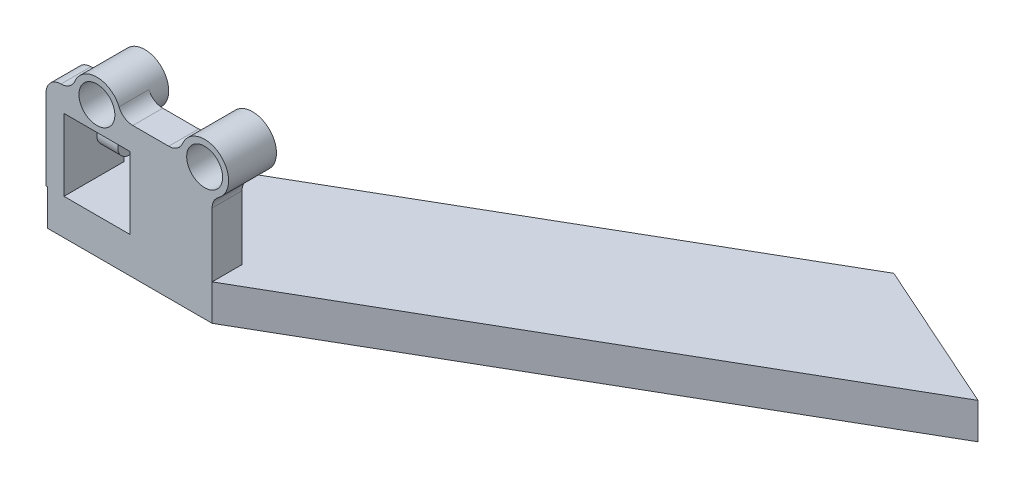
ISO-10303-21;
HEADER;
FILE_DESCRIPTION(('STEP AP214'),'2;1');
FILE_NAME('part.step','',(''),(''),'','','');
FILE_SCHEMA(('AUTOMOTIVE_DESIGN { 1 0 10303 214 1 1 1 1 }'));
ENDSEC;
DATA;
#1=APPLICATION_CONTEXT('core data for automotive mechanical design processes');
#2=APPLICATION_PROTOCOL_DEFINITION('international standard','automotive_design',2000,#1);
#3=PRODUCT_CONTEXT('',#1,'mechanical');
#4=PRODUCT('Part','Part','',(#3));
#5=PRODUCT_RELATED_PRODUCT_CATEGORY('part','',(#4));
#6=PRODUCT_DEFINITION_FORMATION('','',#4);
#7=PRODUCT_DEFINITION_CONTEXT('part definition',#1,'design');
#8=PRODUCT_DEFINITION('design','',#6,#7);
#9=PRODUCT_DEFINITION_SHAPE('','',#8);
#10=(LENGTH_UNIT() NAMED_UNIT(*) SI_UNIT(.MILLI.,.METRE.));
#11=(NAMED_UNIT(*) PLANE_ANGLE_UNIT() SI_UNIT($,.RADIAN.));
#12=(NAMED_UNIT(*) SI_UNIT($,.STERADIAN.) SOLID_ANGLE_UNIT());
#13=UNCERTAINTY_MEASURE_WITH_UNIT(LENGTH_MEASURE(1.E-05),#10,'distance_accuracy_value','');
#14=(GEOMETRIC_REPRESENTATION_CONTEXT(3) GLOBAL_UNCERTAINTY_ASSIGNED_CONTEXT((#13)) GLOBAL_UNIT_ASSIGNED_CONTEXT((#10,
#11,#12)) REPRESENTATION_CONTEXT('',''));
#15=CARTESIAN_POINT('',(0.,0.,0.));
#16=DIRECTION('',(0.,0.,1.));
#17=DIRECTION('',(1.,0.,0.));
#18=AXIS2_PLACEMENT_3D('',#15,#16,#17);
#19=CARTESIAN_POINT('',(0.,0.,5.));
#20=DIRECTION('',(0.,1.,0.));
#21=DIRECTION('',(0.,0.,1.));
#22=AXIS2_PLACEMENT_3D('',#19,#20,#21);
#23=PLANE('',#22);
#24=DIRECTION('',(-0.023897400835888,0.,-0.99971441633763));
#25=VECTOR('',#24,1.);
#26=CARTESIAN_POINT('',(0.478084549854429,0.,5.));
#27=LINE('',#26,#25);
#28=CARTESIAN_POINT('',(0.478084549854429,0.,5.));
#29=VERTEX_POINT('',#28);
#30=CARTESIAN_POINT('',(0.,0.,-15.));
#31=VERTEX_POINT('',#30);
#32=EDGE_CURVE('E1523',#29,#31,#27,.T.);
#33=ORIENTED_EDGE('',*,*,#32,.F.);
#34=DIRECTION('',(1.,0.,0.));
#35=VECTOR('',#34,1.);
#36=CARTESIAN_POINT('',(0.,0.,5.));
#37=LINE('',#36,#35);
#38=CARTESIAN_POINT('',(0.,0.,5.));
#39=VERTEX_POINT('',#38);
#40=EDGE_CURVE('E341',#39,#29,#37,.T.);
#41=ORIENTED_EDGE('',*,*,#40,.F.);
#42=DIRECTION('',(0.,0.,-1.));
#43=VECTOR('',#42,1.);
#44=CARTESIAN_POINT('',(0.,0.,5.));
#45=LINE('',#44,#43);
#46=EDGE_CURVE('E560',#39,#31,#45,.T.);
#47=ORIENTED_EDGE('',*,*,#46,.T.);
#48=EDGE_LOOP('',(#33,#41,#47));
#49=FACE_BOUND('',#48,.T.);
#50=ADVANCED_FACE('F43',(#49),#23,.F.);
#51=CARTESIAN_POINT('',(8.,32.,0.));
#52=DIRECTION('',(0.,0.,-1.));
#53=DIRECTION('',(-1.,0.,0.));
#54=AXIS2_PLACEMENT_3D('',#51,#52,#53);
#55=PLANE('',#54);
#56=DIRECTION('',(-1.,0.,0.));
#57=VECTOR('',#56,1.);
#58=CARTESIAN_POINT('',(46.7550020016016,27.,0.));
#59=LINE('',#58,#57);
#60=CARTESIAN_POINT('',(44.6933761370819,27.,0.));
#61=VERTEX_POINT('',#60);
#62=CARTESIAN_POINT('',(34.,27.,0.));
#63=VERTEX_POINT('',#62);
#64=EDGE_CURVE('E525',#61,#63,#59,.T.);
#65=ORIENTED_EDGE('',*,*,#64,.F.);
#66=CARTESIAN_POINT('',(44.6933761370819,22.,0.));
#67=DIRECTION('',(0.,0.,-1.));
#68=DIRECTION('',(-1.,0.,0.));
#69=AXIS2_PLACEMENT_3D('',#66,#67,#68);
#70=CIRCLE('',#69,5.);
#71=CARTESIAN_POINT('',(47.8882314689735,25.8461538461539,0.));
#72=VERTEX_POINT('',#71);
#73=EDGE_CURVE('E607',#61,#72,#70,.T.);
#74=ORIENTED_EDGE('',*,*,#73,.T.);
#75=CARTESIAN_POINT('',(53.,32.,0.));
#76=DIRECTION('',(0.,0.,-1.));
#77=DIRECTION('',(-1.,0.,0.));
#78=AXIS2_PLACEMENT_3D('',#75,#76,#77);
#79=CIRCLE('',#78,8.);
#80=CARTESIAN_POINT('',(48.3846153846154,25.4656121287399,0.));
#81=VERTEX_POINT('',#80);
#82=EDGE_CURVE('E556',#81,#72,#79,.T.);
#83=ORIENTED_EDGE('',*,*,#82,.F.);
#84=CARTESIAN_POINT('',(45.5,21.3816197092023,0.));
#85=DIRECTION('',(0.,0.,-1.));
#86=DIRECTION('',(-1.,0.,0.));
#87=AXIS2_PLACEMENT_3D('',#84,#85,#86);
#88=CIRCLE('',#87,5.);
#89=CARTESIAN_POINT('',(50.5,21.3816197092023,0.));
#90=VERTEX_POINT('',#89);
#91=EDGE_CURVE('E605',#81,#90,#88,.T.);
#92=ORIENTED_EDGE('',*,*,#91,.T.);
#93=DIRECTION('',(0.,1.,0.));
#94=VECTOR('',#93,1.);
#95=CARTESIAN_POINT('',(50.5,0.,0.));
#96=LINE('',#95,#94);
#97=CARTESIAN_POINT('',(50.5,0.,0.));
#98=VERTEX_POINT('',#97);
#99=EDGE_CURVE('E511',#98,#90,#96,.T.);
#100=ORIENTED_EDGE('',*,*,#99,.F.);
#101=DIRECTION('',(1.,0.,0.));
#102=VECTOR('',#101,1.);
#103=CARTESIAN_POINT('',(28.,0.,0.));
#104=LINE('',#103,#102);
#105=CARTESIAN_POINT('',(34.,0.,0.));
#106=VERTEX_POINT('',#105);
#107=EDGE_CURVE('E563',#106,#98,#104,.T.);
#108=ORIENTED_EDGE('',*,*,#107,.F.);
#109=DIRECTION('',(0.,1.,0.));
#110=VECTOR('',#109,1.);
#111=CARTESIAN_POINT('',(34.,0.,0.));
#112=LINE('',#111,#110);
#113=EDGE_CURVE('E419',#106,#63,#112,.T.);
#114=ORIENTED_EDGE('',*,*,#113,.T.);
#115=EDGE_LOOP('',(#65,#74,#83,#92,#100,#108,#114));
#116=FACE_BOUND('',#115,.T.);
#117=ADVANCED_FACE('F703',(#116),#55,.T.);
#118=CARTESIAN_POINT('',(46.7550020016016,27.,-5.));
#119=DIRECTION('',(0.,1.,0.));
#120=DIRECTION('',(0.,0.,1.));
#121=AXIS2_PLACEMENT_3D('',#118,#119,#120);
#122=PLANE('',#121);
#123=DIRECTION('',(-1.,0.,0.));
#124=VECTOR('',#123,1.);
#125=CARTESIAN_POINT('',(46.7550020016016,27.,-5.));
#126=LINE('',#125,#124);
#127=CARTESIAN_POINT('',(44.6933761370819,27.,-5.));
#128=VERTEX_POINT('',#127);
#129=CARTESIAN_POINT('',(34.,27.,-5.));
#130=VERTEX_POINT('',#129);
#131=EDGE_CURVE('E526',#128,#130,#126,.T.);
#132=ORIENTED_EDGE('',*,*,#131,.F.);
#133=DIRECTION('',(0.,0.,1.));
#134=VECTOR('',#133,1.);
#135=CARTESIAN_POINT('',(44.6933761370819,27.,0.));
#136=LINE('',#135,#134);
#137=EDGE_CURVE('E600',#128,#61,#136,.T.);
#138=ORIENTED_EDGE('',*,*,#137,.T.);
#139=ORIENTED_EDGE('',*,*,#64,.T.);
#140=DIRECTION('',(0.,0.,-1.));
#141=VECTOR('',#140,1.);
#142=CARTESIAN_POINT('',(34.,27.,-5.));
#143=LINE('',#142,#141);
#144=EDGE_CURVE('E422',#63,#130,#143,.T.);
#145=ORIENTED_EDGE('',*,*,#144,.T.);
#146=EDGE_LOOP('',(#132,#138,#139,#145));
#147=FACE_BOUND('',#146,.T.);
#148=ADVANCED_FACE('F719',(#147),#122,.F.);
#149=DIRECTION('',(-1.,0.,0.));
#150=VECTOR('',#149,1.);
#151=CARTESIAN_POINT('',(10.7550020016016,27.,0.));
#152=LINE('',#151,#150);
#153=CARTESIAN_POINT('',(8.69337613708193,27.,0.));
#154=VERTEX_POINT('',#153);
#155=CARTESIAN_POINT('',(6.,27.,0.));
#156=VERTEX_POINT('',#155);
#157=EDGE_CURVE('E500',#154,#156,#152,.T.);
#158=ORIENTED_EDGE('',*,*,#157,.F.);
#159=CARTESIAN_POINT('',(8.69337613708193,22.,0.));
#160=DIRECTION('',(0.,0.,-1.));
#161=DIRECTION('',(-1.,0.,0.));
#162=AXIS2_PLACEMENT_3D('',#159,#160,#161);
#163=CIRCLE('',#162,5.);
#164=CARTESIAN_POINT('',(11.8882314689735,25.8461538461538,0.));
#165=VERTEX_POINT('',#164);
#166=EDGE_CURVE('E647',#154,#165,#163,.T.);
#167=ORIENTED_EDGE('',*,*,#166,.T.);
#168=CARTESIAN_POINT('',(17.,32.,0.));
#169=DIRECTION('',(0.,0.,-1.));
#170=DIRECTION('',(-1.,0.,0.));
#171=AXIS2_PLACEMENT_3D('',#168,#169,#170);
#172=CIRCLE('',#171,8.);
#173=CARTESIAN_POINT('',(17.,24.,0.));
#174=VERTEX_POINT('',#173);
#175=EDGE_CURVE('E559',#165,#174,#172,.F.);
#176=ORIENTED_EDGE('',*,*,#175,.T.);
#177=DIRECTION('',(1.,0.,0.));
#178=VECTOR('',#177,1.);
#179=CARTESIAN_POINT('',(6.,24.,0.));
#180=LINE('',#179,#178);
#181=CARTESIAN_POINT('',(6.,24.,0.));
#182=VERTEX_POINT('',#181);
#183=EDGE_CURVE('E575',#182,#174,#180,.T.);
#184=ORIENTED_EDGE('',*,*,#183,.F.);
#185=DIRECTION('',(0.,1.,0.));
#186=VECTOR('',#185,1.);
#187=CARTESIAN_POINT('',(6.,0.,0.));
#188=LINE('',#187,#186);
#189=EDGE_CURVE('E458',#182,#156,#188,.T.);
#190=ORIENTED_EDGE('',*,*,#189,.T.);
#191=EDGE_LOOP('',(#158,#167,#176,#184,#190));
#192=FACE_BOUND('',#191,.T.);
#193=ADVANCED_FACE('F758',(#192),#55,.T.);
#194=CARTESIAN_POINT('',(10.7550020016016,27.,-5.));
#195=DIRECTION('',(0.,1.,0.));
#196=DIRECTION('',(0.,0.,1.));
#197=AXIS2_PLACEMENT_3D('',#194,#195,#196);
#198=PLANE('',#197);
#199=DIRECTION('',(-1.,0.,0.));
#200=VECTOR('',#199,1.);
#201=CARTESIAN_POINT('',(10.7550020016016,27.,-5.));
#202=LINE('',#201,#200);
#203=CARTESIAN_POINT('',(8.69337613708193,27.,-5.));
#204=VERTEX_POINT('',#203);
#205=CARTESIAN_POINT('',(6.,27.,-5.));
#206=VERTEX_POINT('',#205);
#207=EDGE_CURVE('E499',#204,#206,#202,.T.);
#208=ORIENTED_EDGE('',*,*,#207,.F.);
#209=DIRECTION('',(0.,0.,-1.));
#210=VECTOR('',#209,1.);
#211=CARTESIAN_POINT('',(8.69337613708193,27.,0.));
#212=LINE('',#211,#210);
#213=EDGE_CURVE('E644',#204,#154,#212,.F.);
#214=ORIENTED_EDGE('',*,*,#213,.T.);
#215=ORIENTED_EDGE('',*,*,#157,.T.);
#216=DIRECTION('',(0.,0.,-1.));
#217=VECTOR('',#216,1.);
#218=CARTESIAN_POINT('',(6.,27.,-5.));
#219=LINE('',#218,#217);
#220=EDGE_CURVE('E461',#156,#206,#219,.T.);
#221=ORIENTED_EDGE('',*,*,#220,.T.);
#222=EDGE_LOOP('',(#208,#214,#215,#221));
#223=FACE_BOUND('',#222,.T.);
#224=ADVANCED_FACE('F769',(#223),#198,.F.);
#225=CARTESIAN_POINT('',(17.,32.,-11.));
#226=DIRECTION('',(0.,0.,1.));
#227=DIRECTION('',(1.,0.,0.));
#228=AXIS2_PLACEMENT_3D('',#225,#226,#227);
#229=CYLINDRICAL_SURFACE('',#228,8.);
#230=CARTESIAN_POINT('',(17.,32.,-11.));
#231=DIRECTION('',(0.,0.,-1.));
#232=DIRECTION('',(-1.,0.,0.));
#233=AXIS2_PLACEMENT_3D('',#230,#231,#232);
#234=CIRCLE('',#233,8.);
#235=CARTESIAN_POINT('',(9.,32.,-11.));
#236=VERTEX_POINT('',#235);
#237=EDGE_CURVE('E542',#236,#236,#234,.T.);
#238=ORIENTED_EDGE('',*,*,#237,.F.);
#239=EDGE_LOOP('',(#238));
#240=FACE_BOUND('',#239,.T.);
#241=CARTESIAN_POINT('',(17.,32.,-5.));
#242=DIRECTION('',(0.,0.,1.));
#243=DIRECTION('',(-1.,0.,0.));
#244=AXIS2_PLACEMENT_3D('',#241,#242,#243);
#245=CIRCLE('',#244,8.);
#246=CARTESIAN_POINT('',(9.61538461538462,35.0769230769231,-5.));
#247=VERTEX_POINT('',#246);
#248=CARTESIAN_POINT('',(11.8882314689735,25.8461538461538,-5.));
#249=VERTEX_POINT('',#248);
#250=EDGE_CURVE('E503',#247,#249,#245,.T.);
#251=ORIENTED_EDGE('',*,*,#250,.F.);
#252=DIRECTION('',(0.,0.,1.));
#253=VECTOR('',#252,1.);
#254=CARTESIAN_POINT('',(9.61538461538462,35.0769230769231,-11.));
#255=LINE('',#254,#253);
#256=CARTESIAN_POINT('',(9.61538461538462,35.0769230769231,5.));
#257=VERTEX_POINT('',#256);
#258=EDGE_CURVE('E630',#247,#257,#255,.T.);
#259=ORIENTED_EDGE('',*,*,#258,.T.);
#260=CARTESIAN_POINT('',(17.,32.,5.));
#261=DIRECTION('',(0.,0.,-1.));
#262=DIRECTION('',(-1.,0.,0.));
#263=AXIS2_PLACEMENT_3D('',#260,#261,#262);
#264=CIRCLE('',#263,8.00000000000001);
#265=CARTESIAN_POINT('',(24.3846153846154,35.0769230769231,5.));
#266=VERTEX_POINT('',#265);
#267=EDGE_CURVE('E493',#257,#266,#264,.T.);
#268=ORIENTED_EDGE('',*,*,#267,.T.);
#269=DIRECTION('',(0.,0.,1.));
#270=VECTOR('',#269,1.);
#271=CARTESIAN_POINT('',(24.3846153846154,35.0769230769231,-11.));
#272=LINE('',#271,#270);
#273=CARTESIAN_POINT('',(24.3846153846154,35.0769230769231,-5.));
#274=VERTEX_POINT('',#273);
#275=EDGE_CURVE('E627',#266,#274,#272,.F.);
#276=ORIENTED_EDGE('',*,*,#275,.T.);
#277=CARTESIAN_POINT('',(17.,32.,-5.));
#278=DIRECTION('',(0.,0.,1.));
#279=DIRECTION('',(-1.,0.,0.));
#280=AXIS2_PLACEMENT_3D('',#277,#278,#279);
#281=CIRCLE('',#280,8.);
#282=CARTESIAN_POINT('',(22.1117685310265,25.8461538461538,-5.));
#283=VERTEX_POINT('',#282);
#284=EDGE_CURVE('E528',#283,#274,#281,.T.);
#285=ORIENTED_EDGE('',*,*,#284,.F.);
#286=DIRECTION('',(0.,0.,1.));
#287=VECTOR('',#286,1.);
#288=CARTESIAN_POINT('',(22.1117685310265,25.8461538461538,-11.));
#289=LINE('',#288,#287);
#290=CARTESIAN_POINT('',(22.1117685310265,25.8461538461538,0.));
#291=VERTEX_POINT('',#290);
#292=EDGE_CURVE('E621',#283,#291,#289,.T.);
#293=ORIENTED_EDGE('',*,*,#292,.T.);
#294=CARTESIAN_POINT('',(17.,32.,0.));
#295=DIRECTION('',(0.,0.,-1.));
#296=DIRECTION('',(-1.,0.,0.));
#297=AXIS2_PLACEMENT_3D('',#294,#295,#296);
#298=CIRCLE('',#297,8.);
#299=EDGE_CURVE('E547',#291,#174,#298,.T.);
#300=ORIENTED_EDGE('',*,*,#299,.T.);
#301=ORIENTED_EDGE('',*,*,#175,.F.);
#302=DIRECTION('',(0.,0.,1.));
#303=VECTOR('',#302,1.);
#304=CARTESIAN_POINT('',(11.8882314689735,25.8461538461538,-11.));
#305=LINE('',#304,#303);
#306=EDGE_CURVE('E624',#165,#249,#305,.F.);
#307=ORIENTED_EDGE('',*,*,#306,.T.);
#308=EDGE_LOOP('',(#251,#259,#268,#276,#285,#293,#300,#301,#307));
#309=FACE_BOUND('',#308,.T.);
#310=ADVANCED_FACE('F742',(#240,#309),#229,.T.);
#311=ORIENTED_EDGE('',*,*,#299,.F.);
#312=CARTESIAN_POINT('',(25.3066238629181,22.,0.));
#313=DIRECTION('',(0.,0.,-1.));
#314=DIRECTION('',(-1.,0.,0.));
#315=AXIS2_PLACEMENT_3D('',#312,#313,#314);
#316=CIRCLE('',#315,5.);
#317=CARTESIAN_POINT('',(25.3066238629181,27.,0.));
#318=VERTEX_POINT('',#317);
#319=EDGE_CURVE('E649',#291,#318,#316,.T.);
#320=ORIENTED_EDGE('',*,*,#319,.T.);
#321=CARTESIAN_POINT('',(28.,27.,0.));
#322=VERTEX_POINT('',#321);
#323=EDGE_CURVE('E513',#322,#318,#59,.T.);
#324=ORIENTED_EDGE('',*,*,#323,.F.);
#325=DIRECTION('',(0.,1.,0.));
#326=VECTOR('',#325,1.);
#327=CARTESIAN_POINT('',(28.,0.,0.));
#328=LINE('',#327,#326);
#329=CARTESIAN_POINT('',(28.,24.,0.));
#330=VERTEX_POINT('',#329);
#331=EDGE_CURVE('E418',#330,#322,#328,.T.);
#332=ORIENTED_EDGE('',*,*,#331,.F.);
#333=EDGE_CURVE('E555',#174,#330,#180,.T.);
#334=ORIENTED_EDGE('',*,*,#333,.F.);
#335=EDGE_LOOP('',(#311,#320,#324,#332,#334));
#336=FACE_BOUND('',#335,.T.);
#337=ADVANCED_FACE('F746',(#336),#55,.T.);
#338=CARTESIAN_POINT('',(53.,32.,5.));
#339=DIRECTION('',(0.,0.,-1.));
#340=DIRECTION('',(-1.,0.,0.));
#341=AXIS2_PLACEMENT_3D('',#338,#339,#340);
#342=CYLINDRICAL_SURFACE('',#341,8.);
#343=ORIENTED_EDGE('',*,*,#82,.T.);
#344=DIRECTION('',(0.,0.,-1.));
#345=VECTOR('',#344,1.);
#346=CARTESIAN_POINT('',(47.8882314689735,25.8461538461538,5.));
#347=LINE('',#346,#345);
#348=CARTESIAN_POINT('',(47.8882314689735,25.8461538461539,-5.));
#349=VERTEX_POINT('',#348);
#350=EDGE_CURVE('E618',#72,#349,#347,.T.);
#351=ORIENTED_EDGE('',*,*,#350,.T.);
#352=CARTESIAN_POINT('',(53.,32.,-5.));
#353=DIRECTION('',(0.,0.,1.));
#354=DIRECTION('',(-1.,0.,0.));
#355=AXIS2_PLACEMENT_3D('',#352,#353,#354);
#356=CIRCLE('',#355,7.99999999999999);
#357=CARTESIAN_POINT('',(45.6153846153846,35.0769230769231,-5.));
#358=VERTEX_POINT('',#357);
#359=EDGE_CURVE('E522',#358,#349,#356,.T.);
#360=ORIENTED_EDGE('',*,*,#359,.F.);
#361=DIRECTION('',(0.,0.,-1.));
#362=VECTOR('',#361,1.);
#363=CARTESIAN_POINT('',(45.6153846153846,35.0769230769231,5.));
#364=LINE('',#363,#362);
#365=CARTESIAN_POINT('',(45.6153846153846,35.0769230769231,5.));
#366=VERTEX_POINT('',#365);
#367=EDGE_CURVE('E615',#358,#366,#364,.F.);
#368=ORIENTED_EDGE('',*,*,#367,.T.);
#369=CARTESIAN_POINT('',(53.,32.,5.));
#370=DIRECTION('',(0.,0.,1.));
#371=DIRECTION('',(-1.,0.,0.));
#372=AXIS2_PLACEMENT_3D('',#369,#370,#371);
#373=CIRCLE('',#372,8.);
#374=CARTESIAN_POINT('',(57.6153846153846,25.4656121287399,5.));
#375=VERTEX_POINT('',#374);
#376=EDGE_CURVE('E571',#375,#366,#373,.T.);
#377=ORIENTED_EDGE('',*,*,#376,.F.);
#378=DIRECTION('',(0.,0.,-1.));
#379=VECTOR('',#378,1.);
#380=CARTESIAN_POINT('',(57.6153846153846,25.4656121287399,5.));
#381=LINE('',#380,#379);
#382=CARTESIAN_POINT('',(57.6153846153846,25.4656121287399,-5.));
#383=VERTEX_POINT('',#382);
#384=EDGE_CURVE('E609',#375,#383,#381,.T.);
#385=ORIENTED_EDGE('',*,*,#384,.T.);
#386=CARTESIAN_POINT('',(53.,32.,-5.));
#387=DIRECTION('',(0.,0.,1.));
#388=DIRECTION('',(-1.,0.,0.));
#389=AXIS2_PLACEMENT_3D('',#386,#387,#388);
#390=CIRCLE('',#389,8.);
#391=CARTESIAN_POINT('',(48.3846153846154,25.4656121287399,-5.));
#392=VERTEX_POINT('',#391);
#393=EDGE_CURVE('E516',#392,#383,#390,.T.);
#394=ORIENTED_EDGE('',*,*,#393,.F.);
#395=DIRECTION('',(0.,0.,-1.));
#396=VECTOR('',#395,1.);
#397=CARTESIAN_POINT('',(48.3846153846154,25.4656121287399,5.));
#398=LINE('',#397,#396);
#399=EDGE_CURVE('E612',#392,#81,#398,.F.);
#400=ORIENTED_EDGE('',*,*,#399,.T.);
#401=EDGE_LOOP('',(#343,#351,#360,#368,#377,#385,#394,#400));
#402=FACE_BOUND('',#401,.T.);
#403=CARTESIAN_POINT('',(53.,32.,-11.));
#404=DIRECTION('',(0.,0.,-1.));
#405=DIRECTION('',(-1.,0.,0.));
#406=AXIS2_PLACEMENT_3D('',#403,#404,#405);
#407=CIRCLE('',#406,8.);
#408=CARTESIAN_POINT('',(45.,32.,-11.));
#409=VERTEX_POINT('',#408);
#410=EDGE_CURVE('E550',#409,#409,#407,.T.);
#411=ORIENTED_EDGE('',*,*,#410,.F.);
#412=EDGE_LOOP('',(#411));
#413=FACE_BOUND('',#412,.T.);
#414=ADVANCED_FACE('F687',(#402,#413),#342,.T.);
#415=CARTESIAN_POINT('',(0.,0.,5.));
#416=DIRECTION('',(1.,0.,0.));
#417=DIRECTION('',(0.,0.,-1.));
#418=AXIS2_PLACEMENT_3D('',#415,#416,#417);
#419=PLANE('',#418);
#420=CARTESIAN_POINT('',(0.,12.,-10.));
#421=DIRECTION('',(-1.,0.,0.));
#422=DIRECTION('',(0.,0.,1.));
#423=AXIS2_PLACEMENT_3D('',#420,#421,#422);
#424=CIRCLE('',#423,4.);
#425=CARTESIAN_POINT('',(0.,12.,-6.));
#426=VERTEX_POINT('',#425);
#427=EDGE_CURVE('E396',#426,#426,#424,.T.);
#428=ORIENTED_EDGE('',*,*,#427,.F.);
#429=EDGE_LOOP('',(#428));
#430=FACE_BOUND('',#429,.T.);
#431=DIRECTION('',(0.,-1.,0.));
#432=VECTOR('',#431,1.);
#433=CARTESIAN_POINT('',(0.,0.,5.));
#434=LINE('',#433,#432);
#435=CARTESIAN_POINT('',(0.,27.,5.));
#436=VERTEX_POINT('',#435);
#437=EDGE_CURVE('E561',#436,#39,#434,.T.);
#438=ORIENTED_EDGE('',*,*,#437,.F.);
#439=DIRECTION('',(0.,0.,-1.));
#440=VECTOR('',#439,1.);
#441=CARTESIAN_POINT('',(0.,27.,5.));
#442=LINE('',#441,#440);
#443=CARTESIAN_POINT('',(0.,27.,-5.));
#444=VERTEX_POINT('',#443);
#445=EDGE_CURVE('E638',#436,#444,#442,.T.);
#446=ORIENTED_EDGE('',*,*,#445,.T.);
#447=DIRECTION('',(0.,-0.499999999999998,-0.86602540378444));
#448=VECTOR('',#447,1.);
#449=CARTESIAN_POINT('',(0.,27.,-5.));
#450=LINE('',#449,#448);
#451=CARTESIAN_POINT('',(0.,23.5358983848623,-11.));
#452=VERTEX_POINT('',#451);
#453=EDGE_CURVE('E451',#444,#452,#450,.T.);
#454=ORIENTED_EDGE('',*,*,#453,.T.);
#455=CARTESIAN_POINT('',(0.,16.6076951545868,-7.));
#456=DIRECTION('',(-1.,0.,0.));
#457=DIRECTION('',(0.,0.,1.));
#458=AXIS2_PLACEMENT_3D('',#455,#456,#457);
#459=CIRCLE('',#458,8.00000000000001);
#460=CARTESIAN_POINT('',(0.,16.6076951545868,-15.));
#461=VERTEX_POINT('',#460);
#462=EDGE_CURVE('E477',#452,#461,#459,.T.);
#463=ORIENTED_EDGE('',*,*,#462,.T.);
#464=DIRECTION('',(0.,-1.,0.));
#465=VECTOR('',#464,1.);
#466=CARTESIAN_POINT('',(0.,16.6076951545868,-15.));
#467=LINE('',#466,#465);
#468=EDGE_CURVE('E462',#461,#31,#467,.T.);
#469=ORIENTED_EDGE('',*,*,#468,.T.);
#470=ORIENTED_EDGE('',*,*,#46,.F.);
#471=EDGE_LOOP('',(#438,#446,#454,#463,#469,#470));
#472=FACE_BOUND('',#471,.T.);
#473=ADVANCED_FACE('F823',(#430,#472),#419,.F.);
#474=CARTESIAN_POINT('',(6.,0.,5.));
#475=DIRECTION('',(-1.,0.,0.));
#476=DIRECTION('',(0.,0.,1.));
#477=AXIS2_PLACEMENT_3D('',#474,#475,#476);
#478=PLANE('',#477);
#479=CARTESIAN_POINT('',(6.,12.,-10.));
#480=DIRECTION('',(-1.,0.,0.));
#481=DIRECTION('',(0.,0.,1.));
#482=AXIS2_PLACEMENT_3D('',#479,#480,#481);
#483=CIRCLE('',#482,4.);
#484=CARTESIAN_POINT('',(6.,12.,-6.));
#485=VERTEX_POINT('',#484);
#486=EDGE_CURVE('E594',#485,#485,#483,.F.);
#487=ORIENTED_EDGE('',*,*,#486,.F.);
#488=EDGE_LOOP('',(#487));
#489=FACE_BOUND('',#488,.T.);
#490=DIRECTION('',(0.,0.,-1.));
#491=VECTOR('',#490,1.);
#492=CARTESIAN_POINT('',(6.,0.,5.));
#493=LINE('',#492,#491);
#494=CARTESIAN_POINT('',(6.,0.,5.));
#495=VERTEX_POINT('',#494);
#496=CARTESIAN_POINT('',(6.,0.,-15.));
#497=VERTEX_POINT('',#496);
#498=EDGE_CURVE('E588',#495,#497,#493,.T.);
#499=ORIENTED_EDGE('',*,*,#498,.T.);
#500=DIRECTION('',(0.,-1.,0.));
#501=VECTOR('',#500,1.);
#502=CARTESIAN_POINT('',(6.,16.6076951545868,-15.));
#503=LINE('',#502,#501);
#504=CARTESIAN_POINT('',(6.,16.6076951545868,-15.));
#505=VERTEX_POINT('',#504);
#506=EDGE_CURVE('E471',#505,#497,#503,.T.);
#507=ORIENTED_EDGE('',*,*,#506,.F.);
#508=CARTESIAN_POINT('',(6.,16.6076951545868,-7.));
#509=DIRECTION('',(-1.,0.,0.));
#510=DIRECTION('',(0.,0.,1.));
#511=AXIS2_PLACEMENT_3D('',#508,#509,#510);
#512=CIRCLE('',#511,8.00000000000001);
#513=CARTESIAN_POINT('',(6.,23.5358983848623,-11.));
#514=VERTEX_POINT('',#513);
#515=EDGE_CURVE('E468',#514,#505,#512,.T.);
#516=ORIENTED_EDGE('',*,*,#515,.F.);
#517=DIRECTION('',(0.,-0.499999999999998,-0.86602540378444));
#518=VECTOR('',#517,1.);
#519=CARTESIAN_POINT('',(6.,27.,-5.));
#520=LINE('',#519,#518);
#521=EDGE_CURVE('E465',#206,#514,#520,.T.);
#522=ORIENTED_EDGE('',*,*,#521,.F.);
#523=ORIENTED_EDGE('',*,*,#220,.F.);
#524=ORIENTED_EDGE('',*,*,#189,.F.);
#525=DIRECTION('',(0.,0.,-1.));
#526=VECTOR('',#525,1.);
#527=CARTESIAN_POINT('',(6.,24.,5.));
#528=LINE('',#527,#526);
#529=CARTESIAN_POINT('',(6.,24.,5.));
#530=VERTEX_POINT('',#529);
#531=EDGE_CURVE('E585',#530,#182,#528,.T.);
#532=ORIENTED_EDGE('',*,*,#531,.F.);
#533=DIRECTION('',(0.,1.,0.));
#534=VECTOR('',#533,1.);
#535=CARTESIAN_POINT('',(6.,0.,5.));
#536=LINE('',#535,#534);
#537=EDGE_CURVE('E565',#495,#530,#536,.T.);
#538=ORIENTED_EDGE('',*,*,#537,.F.);
#539=EDGE_LOOP('',(#499,#507,#516,#522,#523,#524,#532,#538));
#540=FACE_BOUND('',#539,.T.);
#541=ADVANCED_FACE('F773',(#489,#540),#478,.F.);
#542=CARTESIAN_POINT('',(6.,24.,5.));
#543=DIRECTION('',(0.,1.,0.));
#544=DIRECTION('',(0.,0.,1.));
#545=AXIS2_PLACEMENT_3D('',#542,#543,#544);
#546=PLANE('',#545);
#547=ORIENTED_EDGE('',*,*,#183,.T.);
#548=ORIENTED_EDGE('',*,*,#333,.T.);
#549=DIRECTION('',(0.,0.,-1.));
#550=VECTOR('',#549,1.);
#551=CARTESIAN_POINT('',(28.,24.,5.));
#552=LINE('',#551,#550);
#553=CARTESIAN_POINT('',(28.,24.,5.));
#554=VERTEX_POINT('',#553);
#555=EDGE_CURVE('E582',#554,#330,#552,.T.);
#556=ORIENTED_EDGE('',*,*,#555,.F.);
#557=DIRECTION('',(1.,0.,0.));
#558=VECTOR('',#557,1.);
#559=CARTESIAN_POINT('',(6.,24.,5.));
#560=LINE('',#559,#558);
#561=EDGE_CURVE('E567',#530,#554,#560,.T.);
#562=ORIENTED_EDGE('',*,*,#561,.F.);
#563=ORIENTED_EDGE('',*,*,#531,.T.);
#564=EDGE_LOOP('',(#547,#548,#556,#562,#563));
#565=FACE_BOUND('',#564,.T.);
#566=ADVANCED_FACE('F753',(#565),#546,.F.);
#567=CARTESIAN_POINT('',(28.,0.,5.));
#568=DIRECTION('',(1.,0.,0.));
#569=DIRECTION('',(0.,0.,-1.));
#570=AXIS2_PLACEMENT_3D('',#567,#568,#569);
#571=PLANE('',#570);
#572=CARTESIAN_POINT('',(28.,12.,-10.));
#573=DIRECTION('',(1.,0.,0.));
#574=DIRECTION('',(0.,0.,-1.));
#575=AXIS2_PLACEMENT_3D('',#572,#573,#574);
#576=CIRCLE('',#575,4.);
#577=CARTESIAN_POINT('',(28.,12.,-14.));
#578=VERTEX_POINT('',#577);
#579=EDGE_CURVE('E597',#578,#578,#576,.F.);
#580=ORIENTED_EDGE('',*,*,#579,.F.);
#581=EDGE_LOOP('',(#580));
#582=FACE_BOUND('',#581,.T.);
#583=ORIENTED_EDGE('',*,*,#555,.T.);
#584=ORIENTED_EDGE('',*,*,#331,.T.);
#585=DIRECTION('',(0.,0.,-1.));
#586=VECTOR('',#585,1.);
#587=CARTESIAN_POINT('',(28.,27.,-5.));
#588=LINE('',#587,#586);
#589=CARTESIAN_POINT('',(28.,27.,-5.));
#590=VERTEX_POINT('',#589);
#591=EDGE_CURVE('E439',#322,#590,#588,.T.);
#592=ORIENTED_EDGE('',*,*,#591,.T.);
#593=DIRECTION('',(0.,-0.499999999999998,-0.86602540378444));
#594=VECTOR('',#593,1.);
#595=CARTESIAN_POINT('',(28.,27.,-5.));
#596=LINE('',#595,#594);
#597=CARTESIAN_POINT('',(28.,23.5358983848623,-11.));
#598=VERTEX_POINT('',#597);
#599=EDGE_CURVE('E441',#590,#598,#596,.T.);
#600=ORIENTED_EDGE('',*,*,#599,.T.);
#601=CARTESIAN_POINT('',(28.,16.6076951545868,-7.));
#602=DIRECTION('',(-1.,0.,0.));
#603=DIRECTION('',(0.,0.,1.));
#604=AXIS2_PLACEMENT_3D('',#601,#602,#603);
#605=CIRCLE('',#604,8.00000000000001);
#606=CARTESIAN_POINT('',(28.,16.6076951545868,-15.));
#607=VERTEX_POINT('',#606);
#608=EDGE_CURVE('E444',#598,#607,#605,.T.);
#609=ORIENTED_EDGE('',*,*,#608,.T.);
#610=DIRECTION('',(0.,-1.,0.));
#611=VECTOR('',#610,1.);
#612=CARTESIAN_POINT('',(28.,16.6076951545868,-15.));
#613=LINE('',#612,#611);
#614=CARTESIAN_POINT('',(28.,0.,-15.));
#615=VERTEX_POINT('',#614);
#616=EDGE_CURVE('E423',#607,#615,#613,.T.);
#617=ORIENTED_EDGE('',*,*,#616,.T.);
#618=DIRECTION('',(0.,0.,-1.));
#619=VECTOR('',#618,1.);
#620=CARTESIAN_POINT('',(28.,0.,5.));
#621=LINE('',#620,#619);
#622=CARTESIAN_POINT('',(28.,0.,5.));
#623=VERTEX_POINT('',#622);
#624=EDGE_CURVE('E574',#623,#615,#621,.T.);
#625=ORIENTED_EDGE('',*,*,#624,.F.);
#626=DIRECTION('',(0.,-1.,0.));
#627=VECTOR('',#626,1.);
#628=CARTESIAN_POINT('',(28.,0.,5.));
#629=LINE('',#628,#627);
#630=EDGE_CURVE('E569',#554,#623,#629,.T.);
#631=ORIENTED_EDGE('',*,*,#630,.F.);
#632=EDGE_LOOP('',(#583,#584,#592,#600,#609,#617,#625,#631));
#633=FACE_BOUND('',#632,.T.);
#634=ADVANCED_FACE('F898',(#582,#633),#571,.F.);
#635=CARTESIAN_POINT('',(8.,32.,5.));
#636=DIRECTION('',(0.,0.,-1.));
#637=DIRECTION('',(-1.,0.,0.));
#638=AXIS2_PLACEMENT_3D('',#635,#636,#637);
#639=PLANE('',#638);
#640=DIRECTION('',(0.,1.,0.));
#641=VECTOR('',#640,1.);
#642=CARTESIAN_POINT('',(55.5,-12.,5.));
#643=LINE('',#642,#641);
#644=CARTESIAN_POINT('',(55.5,-12.,5.));
#645=VERTEX_POINT('',#644);
#646=CARTESIAN_POINT('',(55.5,0.,5.));
#647=VERTEX_POINT('',#646);
#648=EDGE_CURVE('E1534',#645,#647,#643,.T.);
#649=ORIENTED_EDGE('',*,*,#648,.T.);
#650=DIRECTION('',(0.,-1.,0.));
#651=VECTOR('',#650,1.);
#652=CARTESIAN_POINT('',(55.5,0.,5.));
#653=LINE('',#652,#651);
#654=CARTESIAN_POINT('',(55.5,21.3816197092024,5.));
#655=VERTEX_POINT('',#654);
#656=EDGE_CURVE('E485',#655,#647,#653,.T.);
#657=ORIENTED_EDGE('',*,*,#656,.F.);
#658=CARTESIAN_POINT('',(60.5,21.3816197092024,5.));
#659=DIRECTION('',(0.,0.,-1.));
#660=DIRECTION('',(-1.,0.,0.));
#661=AXIS2_PLACEMENT_3D('',#658,#659,#660);
#662=CIRCLE('',#661,5.);
#663=EDGE_CURVE('E52',#655,#375,#662,.T.);
#664=ORIENTED_EDGE('',*,*,#663,.T.);
#665=ORIENTED_EDGE('',*,*,#376,.T.);
#666=CARTESIAN_POINT('',(41.,37.,5.));
#667=DIRECTION('',(0.,0.,-1.));
#668=DIRECTION('',(-1.,0.,0.));
#669=AXIS2_PLACEMENT_3D('',#666,#667,#668);
#670=CIRCLE('',#669,5.);
#671=CARTESIAN_POINT('',(41.,32.,5.));
#672=VERTEX_POINT('',#671);
#673=EDGE_CURVE('E668',#366,#672,#670,.T.);
#674=ORIENTED_EDGE('',*,*,#673,.T.);
#675=DIRECTION('',(1.,0.,0.));
#676=VECTOR('',#675,1.);
#677=CARTESIAN_POINT('',(45.,32.,5.));
#678=LINE('',#677,#676);
#679=CARTESIAN_POINT('',(29.,32.,5.));
#680=VERTEX_POINT('',#679);
#681=EDGE_CURVE('E496',#680,#672,#678,.T.);
#682=ORIENTED_EDGE('',*,*,#681,.F.);
#683=CARTESIAN_POINT('',(29.,37.,5.));
#684=DIRECTION('',(0.,0.,-1.));
#685=DIRECTION('',(-1.,0.,0.));
#686=AXIS2_PLACEMENT_3D('',#683,#684,#685);
#687=CIRCLE('',#686,5.);
#688=EDGE_CURVE('E664',#680,#266,#687,.T.);
#689=ORIENTED_EDGE('',*,*,#688,.T.);
#690=ORIENTED_EDGE('',*,*,#267,.F.);
#691=CARTESIAN_POINT('',(5.,37.,5.));
#692=DIRECTION('',(0.,0.,-1.));
#693=DIRECTION('',(-1.,0.,0.));
#694=AXIS2_PLACEMENT_3D('',#691,#692,#693);
#695=CIRCLE('',#694,5.);
#696=CARTESIAN_POINT('',(5.,32.,5.));
#697=VERTEX_POINT('',#696);
#698=EDGE_CURVE('E659',#257,#697,#695,.T.);
#699=ORIENTED_EDGE('',*,*,#698,.T.);
#700=CARTESIAN_POINT('',(5.,27.,5.));
#701=DIRECTION('',(0.,0.,-1.));
#702=DIRECTION('',(-1.,0.,0.));
#703=AXIS2_PLACEMENT_3D('',#700,#701,#702);
#704=CIRCLE('',#703,5.);
#705=EDGE_CURVE('E642',#697,#436,#704,.F.);
#706=ORIENTED_EDGE('',*,*,#705,.T.);
#707=ORIENTED_EDGE('',*,*,#437,.T.);
#708=ORIENTED_EDGE('',*,*,#40,.T.);
#709=DIRECTION('',(0.,1.,0.));
#710=VECTOR('',#709,1.);
#711=CARTESIAN_POINT('',(0.478084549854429,-12.,5.));
#712=LINE('',#711,#710);
#713=CARTESIAN_POINT('',(0.478084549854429,-12.,5.));
#714=VERTEX_POINT('',#713);
#715=EDGE_CURVE('E319',#714,#29,#712,.T.);
#716=ORIENTED_EDGE('',*,*,#715,.F.);
#717=DIRECTION('',(-1.,0.,0.));
#718=VECTOR('',#717,1.);
#719=CARTESIAN_POINT('',(55.5,-12.,5.));
#720=LINE('',#719,#718);
#721=EDGE_CURVE('E326',#645,#714,#720,.T.);
#722=ORIENTED_EDGE('',*,*,#721,.F.);
#723=EDGE_LOOP('',(#649,#657,#664,#665,#674,#682,#689,#690,#699,#706,#707,#708,#716,#722));
#724=FACE_BOUND('',#723,.T.);
#725=ORIENTED_EDGE('',*,*,#630,.T.);
#726=DIRECTION('',(-1.,0.,0.));
#727=VECTOR('',#726,1.);
#728=CARTESIAN_POINT('',(55.5,0.,5.));
#729=LINE('',#728,#727);
#730=EDGE_CURVE('E1518',#623,#495,#729,.T.);
#731=ORIENTED_EDGE('',*,*,#730,.T.);
#732=ORIENTED_EDGE('',*,*,#537,.T.);
#733=ORIENTED_EDGE('',*,*,#561,.T.);
#734=EDGE_LOOP('',(#725,#731,#732,#733));
#735=FACE_BOUND('',#734,.T.);
#736=CARTESIAN_POINT('',(53.,32.,5.));
#737=DIRECTION('',(0.,0.,-1.));
#738=DIRECTION('',(-1.,0.,0.));
#739=AXIS2_PLACEMENT_3D('',#736,#737,#738);
#740=CIRCLE('',#739,5.99999999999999);
#741=CARTESIAN_POINT('',(47.,32.,5.));
#742=VERTEX_POINT('',#741);
#743=EDGE_CURVE('E538',#742,#742,#740,.F.);
#744=ORIENTED_EDGE('',*,*,#743,.F.);
#745=EDGE_LOOP('',(#744));
#746=FACE_BOUND('',#745,.T.);
#747=CARTESIAN_POINT('',(17.,32.,5.));
#748=DIRECTION('',(0.,0.,-1.));
#749=DIRECTION('',(-1.,0.,0.));
#750=AXIS2_PLACEMENT_3D('',#747,#748,#749);
#751=CIRCLE('',#750,6.);
#752=CARTESIAN_POINT('',(11.,32.,5.));
#753=VERTEX_POINT('',#752);
#754=EDGE_CURVE('E533',#753,#753,#751,.F.);
#755=ORIENTED_EDGE('',*,*,#754,.F.);
#756=EDGE_LOOP('',(#755));
#757=FACE_BOUND('',#756,.T.);
#758=ADVANCED_FACE('F338',(#724,#735,#746,#757),#639,.F.);
#759=CARTESIAN_POINT('',(53.,32.,-11.));
#760=DIRECTION('',(0.,0.,-1.));
#761=DIRECTION('',(-1.,0.,0.));
#762=AXIS2_PLACEMENT_3D('',#759,#760,#761);
#763=PLANE('',#762);
#764=CARTESIAN_POINT('',(53.,32.,-11.));
#765=DIRECTION('',(0.,0.,-1.));
#766=DIRECTION('',(-1.,0.,0.));
#767=AXIS2_PLACEMENT_3D('',#764,#765,#766);
#768=CIRCLE('',#767,5.99999999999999);
#769=CARTESIAN_POINT('',(47.,32.,-11.));
#770=VERTEX_POINT('',#769);
#771=EDGE_CURVE('E535',#770,#770,#768,.T.);
#772=ORIENTED_EDGE('',*,*,#771,.F.);
#773=EDGE_LOOP('',(#772));
#774=FACE_BOUND('',#773,.T.);
#775=ORIENTED_EDGE('',*,*,#410,.T.);
#776=EDGE_LOOP('',(#775));
#777=FACE_BOUND('',#776,.T.);
#778=ADVANCED_FACE('F897',(#774,#777),#763,.T.);
#779=CARTESIAN_POINT('',(17.,32.,-11.));
#780=DIRECTION('',(0.,0.,-1.));
#781=DIRECTION('',(-1.,0.,0.));
#782=AXIS2_PLACEMENT_3D('',#779,#780,#781);
#783=PLANE('',#782);
#784=CARTESIAN_POINT('',(17.,32.,-11.));
#785=DIRECTION('',(0.,0.,-1.));
#786=DIRECTION('',(-1.,0.,0.));
#787=AXIS2_PLACEMENT_3D('',#784,#785,#786);
#788=CIRCLE('',#787,6.);
#789=CARTESIAN_POINT('',(11.,32.,-11.));
#790=VERTEX_POINT('',#789);
#791=EDGE_CURVE('E539',#790,#790,#788,.T.);
#792=ORIENTED_EDGE('',*,*,#791,.F.);
#793=EDGE_LOOP('',(#792));
#794=FACE_BOUND('',#793,.T.);
#795=ORIENTED_EDGE('',*,*,#237,.T.);
#796=EDGE_LOOP('',(#795));
#797=FACE_BOUND('',#796,.T.);
#798=ADVANCED_FACE('F1345',(#794,#797),#783,.T.);
#799=CARTESIAN_POINT('',(17.,32.,5.001));
#800=DIRECTION('',(0.,0.,-1.));
#801=DIRECTION('',(-1.,0.,0.));
#802=AXIS2_PLACEMENT_3D('',#799,#800,#801);
#803=CYLINDRICAL_SURFACE('',#802,6.);
#804=ORIENTED_EDGE('',*,*,#791,.T.);
#805=EDGE_LOOP('',(#804));
#806=FACE_BOUND('',#805,.T.);
#807=ORIENTED_EDGE('',*,*,#754,.T.);
#808=EDGE_LOOP('',(#807));
#809=FACE_BOUND('',#808,.T.);
#810=ADVANCED_FACE('F1335',(#806,#809),#803,.F.);
#811=CARTESIAN_POINT('',(53.,32.,5.001));
#812=DIRECTION('',(0.,0.,-1.));
#813=DIRECTION('',(-1.,0.,0.));
#814=AXIS2_PLACEMENT_3D('',#811,#812,#813);
#815=CYLINDRICAL_SURFACE('',#814,5.99999999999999);
#816=ORIENTED_EDGE('',*,*,#771,.T.);
#817=EDGE_LOOP('',(#816));
#818=FACE_BOUND('',#817,.T.);
#819=ORIENTED_EDGE('',*,*,#743,.T.);
#820=EDGE_LOOP('',(#819));
#821=FACE_BOUND('',#820,.T.);
#822=ADVANCED_FACE('F1301',(#818,#821),#815,.F.);
#823=ORIENTED_EDGE('',*,*,#323,.T.);
#824=DIRECTION('',(0.,0.,-1.));
#825=VECTOR('',#824,1.);
#826=CARTESIAN_POINT('',(25.3066238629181,27.,-5.));
#827=LINE('',#826,#825);
#828=CARTESIAN_POINT('',(25.3066238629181,27.,-5.));
#829=VERTEX_POINT('',#828);
#830=EDGE_CURVE('E651',#318,#829,#827,.T.);
#831=ORIENTED_EDGE('',*,*,#830,.T.);
#832=EDGE_CURVE('E524',#590,#829,#126,.T.);
#833=ORIENTED_EDGE('',*,*,#832,.F.);
#834=ORIENTED_EDGE('',*,*,#591,.F.);
#835=EDGE_LOOP('',(#823,#831,#833,#834));
#836=FACE_BOUND('',#835,.T.);
#837=ADVANCED_FACE('F1197',(#836),#122,.F.);
#838=CARTESIAN_POINT('',(45.,32.,-5.));
#839=DIRECTION('',(0.,-1.,0.));
#840=DIRECTION('',(0.,0.,-1.));
#841=AXIS2_PLACEMENT_3D('',#838,#839,#840);
#842=PLANE('',#841);
#843=DIRECTION('',(1.,0.,0.));
#844=VECTOR('',#843,1.);
#845=CARTESIAN_POINT('',(45.,32.,-5.));
#846=LINE('',#845,#844);
#847=CARTESIAN_POINT('',(29.,32.,-5.));
#848=VERTEX_POINT('',#847);
#849=CARTESIAN_POINT('',(41.,32.,-5.));
#850=VERTEX_POINT('',#849);
#851=EDGE_CURVE('E530',#848,#850,#846,.T.);
#852=ORIENTED_EDGE('',*,*,#851,.F.);
#853=DIRECTION('',(0.,0.,-1.));
#854=VECTOR('',#853,1.);
#855=CARTESIAN_POINT('',(29.,32.,5.));
#856=LINE('',#855,#854);
#857=EDGE_CURVE('E635',#848,#680,#856,.F.);
#858=ORIENTED_EDGE('',*,*,#857,.T.);
#859=ORIENTED_EDGE('',*,*,#681,.T.);
#860=DIRECTION('',(0.,0.,1.));
#861=VECTOR('',#860,1.);
#862=CARTESIAN_POINT('',(41.,32.,-5.));
#863=LINE('',#862,#861);
#864=EDGE_CURVE('E633',#672,#850,#863,.F.);
#865=ORIENTED_EDGE('',*,*,#864,.T.);
#866=EDGE_LOOP('',(#852,#858,#859,#865));
#867=FACE_BOUND('',#866,.T.);
#868=ADVANCED_FACE('F799',(#867),#842,.F.);
#869=CARTESIAN_POINT('',(53.,32.,-5.));
#870=DIRECTION('',(0.,0.,-1.));
#871=DIRECTION('',(-1.,0.,0.));
#872=AXIS2_PLACEMENT_3D('',#869,#870,#871);
#873=PLANE('',#872);
#874=ORIENTED_EDGE('',*,*,#359,.T.);
#875=CARTESIAN_POINT('',(44.6933761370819,22.,-5.));
#876=DIRECTION('',(0.,0.,-1.));
#877=DIRECTION('',(-1.,0.,0.));
#878=AXIS2_PLACEMENT_3D('',#875,#876,#877);
#879=CIRCLE('',#878,5.);
#880=EDGE_CURVE('E657',#349,#128,#879,.F.);
#881=ORIENTED_EDGE('',*,*,#880,.T.);
#882=ORIENTED_EDGE('',*,*,#131,.T.);
#883=DIRECTION('',(-1.,0.,0.));
#884=VECTOR('',#883,1.);
#885=CARTESIAN_POINT('',(34.,27.,-5.));
#886=LINE('',#885,#884);
#887=EDGE_CURVE('E437',#130,#590,#886,.T.);
#888=ORIENTED_EDGE('',*,*,#887,.T.);
#889=ORIENTED_EDGE('',*,*,#832,.T.);
#890=CARTESIAN_POINT('',(25.3066238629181,22.,-5.));
#891=DIRECTION('',(0.,0.,-1.));
#892=DIRECTION('',(-1.,0.,0.));
#893=AXIS2_PLACEMENT_3D('',#890,#891,#892);
#894=CIRCLE('',#893,5.);
#895=EDGE_CURVE('E675',#829,#283,#894,.F.);
#896=ORIENTED_EDGE('',*,*,#895,.T.);
#897=ORIENTED_EDGE('',*,*,#284,.T.);
#898=CARTESIAN_POINT('',(29.,37.,-5.));
#899=DIRECTION('',(0.,0.,-1.));
#900=DIRECTION('',(-1.,0.,0.));
#901=AXIS2_PLACEMENT_3D('',#898,#899,#900);
#902=CIRCLE('',#901,5.);
#903=EDGE_CURVE('E666',#274,#848,#902,.F.);
#904=ORIENTED_EDGE('',*,*,#903,.T.);
#905=ORIENTED_EDGE('',*,*,#851,.T.);
#906=CARTESIAN_POINT('',(41.,37.,-5.));
#907=DIRECTION('',(0.,0.,-1.));
#908=DIRECTION('',(-1.,0.,0.));
#909=AXIS2_PLACEMENT_3D('',#906,#907,#908);
#910=CIRCLE('',#909,5.);
#911=EDGE_CURVE('E670',#850,#358,#910,.F.);
#912=ORIENTED_EDGE('',*,*,#911,.T.);
#913=EDGE_LOOP('',(#874,#881,#882,#888,#889,#896,#897,#904,#905,#912));
#914=FACE_BOUND('',#913,.T.);
#915=ADVANCED_FACE('F716',(#914),#873,.T.);
#916=CARTESIAN_POINT('',(50.5,0.,-5.));
#917=DIRECTION('',(1.,0.,0.));
#918=DIRECTION('',(0.,0.,-1.));
#919=AXIS2_PLACEMENT_3D('',#916,#917,#918);
#920=PLANE('',#919);
#921=ORIENTED_EDGE('',*,*,#99,.T.);
#922=DIRECTION('',(0.,0.,1.));
#923=VECTOR('',#922,1.);
#924=CARTESIAN_POINT('',(50.5,21.3816197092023,-5.));
#925=LINE('',#924,#923);
#926=CARTESIAN_POINT('',(50.5,21.3816197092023,-5.));
#927=VERTEX_POINT('',#926);
#928=EDGE_CURVE('E65',#90,#927,#925,.F.);
#929=ORIENTED_EDGE('',*,*,#928,.T.);
#930=DIRECTION('',(0.,1.,0.));
#931=VECTOR('',#930,1.);
#932=CARTESIAN_POINT('',(50.5,0.,-5.));
#933=LINE('',#932,#931);
#934=CARTESIAN_POINT('',(50.5,0.,-5.));
#935=VERTEX_POINT('',#934);
#936=EDGE_CURVE('E518',#935,#927,#933,.T.);
#937=ORIENTED_EDGE('',*,*,#936,.F.);
#938=DIRECTION('',(0.,0.,1.));
#939=VECTOR('',#938,1.);
#940=CARTESIAN_POINT('',(50.5,0.,-5.));
#941=LINE('',#940,#939);
#942=EDGE_CURVE('E502',#935,#98,#941,.T.);
#943=ORIENTED_EDGE('',*,*,#942,.T.);
#944=EDGE_LOOP('',(#921,#929,#937,#943));
#945=FACE_BOUND('',#944,.T.);
#946=ADVANCED_FACE('F700',(#945),#920,.F.);
#947=CARTESIAN_POINT('',(55.5,0.,-5.));
#948=DIRECTION('',(-1.,0.,0.));
#949=DIRECTION('',(0.,0.,1.));
#950=AXIS2_PLACEMENT_3D('',#947,#948,#949);
#951=PLANE('',#950);
#952=DIRECTION('',(0.,-1.,0.));
#953=VECTOR('',#952,1.);
#954=CARTESIAN_POINT('',(55.5,0.,-5.));
#955=LINE('',#954,#953);
#956=CARTESIAN_POINT('',(55.5,21.3816197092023,-5.));
#957=VERTEX_POINT('',#956);
#958=CARTESIAN_POINT('',(55.5,0.,-5.));
#959=VERTEX_POINT('',#958);
#960=EDGE_CURVE('E510',#957,#959,#955,.T.);
#961=ORIENTED_EDGE('',*,*,#960,.F.);
#962=DIRECTION('',(0.,0.,1.));
#963=VECTOR('',#962,1.);
#964=CARTESIAN_POINT('',(55.5,21.3816197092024,5.));
#965=LINE('',#964,#963);
#966=EDGE_CURVE('E654',#957,#655,#965,.T.);
#967=ORIENTED_EDGE('',*,*,#966,.T.);
#968=ORIENTED_EDGE('',*,*,#656,.T.);
#969=DIRECTION('',(0.,0.,1.));
#970=VECTOR('',#969,1.);
#971=CARTESIAN_POINT('',(55.5,0.,-5.));
#972=LINE('',#971,#970);
#973=EDGE_CURVE('E507',#959,#647,#972,.T.);
#974=ORIENTED_EDGE('',*,*,#973,.F.);
#975=EDGE_LOOP('',(#961,#967,#968,#974));
#976=FACE_BOUND('',#975,.T.);
#977=ADVANCED_FACE('F691',(#976),#951,.F.);
#978=CARTESIAN_POINT('',(53.,32.,-5.));
#979=DIRECTION('',(0.,0.,-1.));
#980=DIRECTION('',(-1.,0.,0.));
#981=AXIS2_PLACEMENT_3D('',#978,#979,#980);
#982=PLANE('',#981);
#983=DIRECTION('',(-1.,0.,0.));
#984=VECTOR('',#983,1.);
#985=CARTESIAN_POINT('',(50.5,0.,-5.));
#986=LINE('',#985,#984);
#987=EDGE_CURVE('E514',#959,#935,#986,.T.);
#988=ORIENTED_EDGE('',*,*,#987,.T.);
#989=ORIENTED_EDGE('',*,*,#936,.T.);
#990=CARTESIAN_POINT('',(45.5,21.3816197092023,-5.));
#991=DIRECTION('',(0.,0.,-1.));
#992=DIRECTION('',(-1.,0.,0.));
#993=AXIS2_PLACEMENT_3D('',#990,#991,#992);
#994=CIRCLE('',#993,5.);
#995=EDGE_CURVE('E678',#927,#392,#994,.F.);
#996=ORIENTED_EDGE('',*,*,#995,.T.);
#997=ORIENTED_EDGE('',*,*,#393,.T.);
#998=CARTESIAN_POINT('',(60.5,21.3816197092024,-5.));
#999=DIRECTION('',(0.,0.,-1.));
#1000=DIRECTION('',(-1.,0.,0.));
#1001=AXIS2_PLACEMENT_3D('',#998,#999,#1000);
#1002=CIRCLE('',#1001,5.);
#1003=EDGE_CURVE('E11',#383,#957,#1002,.F.);
#1004=ORIENTED_EDGE('',*,*,#1003,.T.);
#1005=ORIENTED_EDGE('',*,*,#960,.T.);
#1006=EDGE_LOOP('',(#988,#989,#996,#997,#1004,#1005));
#1007=FACE_BOUND('',#1006,.T.);
#1008=ADVANCED_FACE('F694',(#1007),#982,.T.);
#1009=CARTESIAN_POINT('',(17.,32.,-5.));
#1010=DIRECTION('',(0.,0.,-1.));
#1011=DIRECTION('',(-1.,0.,0.));
#1012=AXIS2_PLACEMENT_3D('',#1009,#1010,#1011);
#1013=PLANE('',#1012);
#1014=DIRECTION('',(-1.,0.,0.));
#1015=VECTOR('',#1014,1.);
#1016=CARTESIAN_POINT('',(6.,27.,-5.));
#1017=LINE('',#1016,#1015);
#1018=EDGE_CURVE('E474',#206,#444,#1017,.T.);
#1019=ORIENTED_EDGE('',*,*,#1018,.T.);
#1020=CARTESIAN_POINT('',(5.,27.,-5.));
#1021=DIRECTION('',(0.,0.,-1.));
#1022=DIRECTION('',(-1.,0.,0.));
#1023=AXIS2_PLACEMENT_3D('',#1020,#1021,#1022);
#1024=CIRCLE('',#1023,5.);
#1025=CARTESIAN_POINT('',(5.,32.,-5.));
#1026=VERTEX_POINT('',#1025);
#1027=EDGE_CURVE('E640',#444,#1026,#1024,.T.);
#1028=ORIENTED_EDGE('',*,*,#1027,.T.);
#1029=CARTESIAN_POINT('',(5.,37.,-5.));
#1030=DIRECTION('',(0.,0.,-1.));
#1031=DIRECTION('',(-1.,0.,0.));
#1032=AXIS2_PLACEMENT_3D('',#1029,#1030,#1031);
#1033=CIRCLE('',#1032,5.);
#1034=EDGE_CURVE('E661',#1026,#247,#1033,.F.);
#1035=ORIENTED_EDGE('',*,*,#1034,.T.);
#1036=ORIENTED_EDGE('',*,*,#250,.T.);
#1037=CARTESIAN_POINT('',(8.69337613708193,22.,-5.));
#1038=DIRECTION('',(0.,0.,-1.));
#1039=DIRECTION('',(-1.,0.,0.));
#1040=AXIS2_PLACEMENT_3D('',#1037,#1038,#1039);
#1041=CIRCLE('',#1040,5.);
#1042=EDGE_CURVE('E673',#249,#204,#1041,.F.);
#1043=ORIENTED_EDGE('',*,*,#1042,.T.);
#1044=ORIENTED_EDGE('',*,*,#207,.T.);
#1045=EDGE_LOOP('',(#1019,#1028,#1035,#1036,#1043,#1044));
#1046=FACE_BOUND('',#1045,.T.);
#1047=ADVANCED_FACE('F766',(#1046),#1013,.T.);
#1048=CARTESIAN_POINT('',(6.,16.6076951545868,-15.));
#1049=DIRECTION('',(0.,0.,-1.));
#1050=DIRECTION('',(0.,1.,0.));
#1051=AXIS2_PLACEMENT_3D('',#1048,#1049,#1050);
#1052=PLANE('',#1051);
#1053=ORIENTED_EDGE('',*,*,#468,.F.);
#1054=DIRECTION('',(-1.,0.,0.));
#1055=VECTOR('',#1054,1.);
#1056=CARTESIAN_POINT('',(6.,16.6076951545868,-15.));
#1057=LINE('',#1056,#1055);
#1058=EDGE_CURVE('E486',#505,#461,#1057,.T.);
#1059=ORIENTED_EDGE('',*,*,#1058,.F.);
#1060=ORIENTED_EDGE('',*,*,#506,.T.);
#1061=DIRECTION('',(-1.,0.,0.));
#1062=VECTOR('',#1061,1.);
#1063=CARTESIAN_POINT('',(6.,0.,-15.));
#1064=LINE('',#1063,#1062);
#1065=EDGE_CURVE('E482',#497,#31,#1064,.T.);
#1066=ORIENTED_EDGE('',*,*,#1065,.T.);
#1067=EDGE_LOOP('',(#1053,#1059,#1060,#1066));
#1068=FACE_BOUND('',#1067,.T.);
#1069=ADVANCED_FACE('F1214',(#1068),#1052,.T.);
#1070=CARTESIAN_POINT('',(6.,16.6076951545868,-7.));
#1071=DIRECTION('',(-1.,0.,0.));
#1072=DIRECTION('',(0.,0.,1.));
#1073=AXIS2_PLACEMENT_3D('',#1070,#1071,#1072);
#1074=CYLINDRICAL_SURFACE('',#1073,8.00000000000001);
#1075=ORIENTED_EDGE('',*,*,#462,.F.);
#1076=DIRECTION('',(-1.,0.,0.));
#1077=VECTOR('',#1076,1.);
#1078=CARTESIAN_POINT('',(6.,23.5358983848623,-11.));
#1079=LINE('',#1078,#1077);
#1080=EDGE_CURVE('E488',#514,#452,#1079,.T.);
#1081=ORIENTED_EDGE('',*,*,#1080,.F.);
#1082=ORIENTED_EDGE('',*,*,#515,.T.);
#1083=ORIENTED_EDGE('',*,*,#1058,.T.);
#1084=EDGE_LOOP('',(#1075,#1081,#1082,#1083));
#1085=FACE_BOUND('',#1084,.T.);
#1086=ADVANCED_FACE('F1205',(#1085),#1074,.T.);
#1087=CARTESIAN_POINT('',(6.,27.,-5.));
#1088=DIRECTION('',(0.,0.86602540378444,-0.499999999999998));
#1089=DIRECTION('',(0.,0.499999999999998,0.86602540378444));
#1090=AXIS2_PLACEMENT_3D('',#1087,#1088,#1089);
#1091=PLANE('',#1090);
#1092=ORIENTED_EDGE('',*,*,#453,.F.);
#1093=ORIENTED_EDGE('',*,*,#1018,.F.);
#1094=ORIENTED_EDGE('',*,*,#521,.T.);
#1095=ORIENTED_EDGE('',*,*,#1080,.T.);
#1096=EDGE_LOOP('',(#1092,#1093,#1094,#1095));
#1097=FACE_BOUND('',#1096,.T.);
#1098=ADVANCED_FACE('F778',(#1097),#1091,.T.);
#1099=CARTESIAN_POINT('',(34.,16.6076951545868,-15.));
#1100=DIRECTION('',(0.,0.,-1.));
#1101=DIRECTION('',(0.,1.,0.));
#1102=AXIS2_PLACEMENT_3D('',#1099,#1100,#1101);
#1103=PLANE('',#1102);
#1104=ORIENTED_EDGE('',*,*,#616,.F.);
#1105=DIRECTION('',(-1.,0.,0.));
#1106=VECTOR('',#1105,1.);
#1107=CARTESIAN_POINT('',(34.,16.6076951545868,-15.));
#1108=LINE('',#1107,#1106);
#1109=CARTESIAN_POINT('',(34.,16.6076951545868,-15.));
#1110=VERTEX_POINT('',#1109);
#1111=EDGE_CURVE('E452',#1110,#607,#1108,.T.);
#1112=ORIENTED_EDGE('',*,*,#1111,.F.);
#1113=DIRECTION('',(0.,-1.,0.));
#1114=VECTOR('',#1113,1.);
#1115=CARTESIAN_POINT('',(34.,16.6076951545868,-15.));
#1116=LINE('',#1115,#1114);
#1117=CARTESIAN_POINT('',(34.,0.,-15.));
#1118=VERTEX_POINT('',#1117);
#1119=EDGE_CURVE('E432',#1110,#1118,#1116,.T.);
#1120=ORIENTED_EDGE('',*,*,#1119,.T.);
#1121=DIRECTION('',(-1.,0.,0.));
#1122=VECTOR('',#1121,1.);
#1123=CARTESIAN_POINT('',(34.,0.,-15.));
#1124=LINE('',#1123,#1122);
#1125=EDGE_CURVE('E449',#1118,#615,#1124,.T.);
#1126=ORIENTED_EDGE('',*,*,#1125,.T.);
#1127=EDGE_LOOP('',(#1104,#1112,#1120,#1126));
#1128=FACE_BOUND('',#1127,.T.);
#1129=ADVANCED_FACE('F1169',(#1128),#1103,.T.);
#1130=CARTESIAN_POINT('',(34.,16.6076951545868,-7.));
#1131=DIRECTION('',(-1.,0.,0.));
#1132=DIRECTION('',(0.,0.,1.));
#1133=AXIS2_PLACEMENT_3D('',#1130,#1131,#1132);
#1134=CYLINDRICAL_SURFACE('',#1133,8.00000000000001);
#1135=ORIENTED_EDGE('',*,*,#608,.F.);
#1136=DIRECTION('',(-1.,0.,0.));
#1137=VECTOR('',#1136,1.);
#1138=CARTESIAN_POINT('',(34.,23.5358983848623,-11.));
#1139=LINE('',#1138,#1137);
#1140=CARTESIAN_POINT('',(34.,23.5358983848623,-11.));
#1141=VERTEX_POINT('',#1140);
#1142=EDGE_CURVE('E454',#1141,#598,#1139,.T.);
#1143=ORIENTED_EDGE('',*,*,#1142,.F.);
#1144=CARTESIAN_POINT('',(34.,16.6076951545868,-7.));
#1145=DIRECTION('',(-1.,0.,0.));
#1146=DIRECTION('',(0.,0.,1.));
#1147=AXIS2_PLACEMENT_3D('',#1144,#1145,#1146);
#1148=CIRCLE('',#1147,8.00000000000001);
#1149=EDGE_CURVE('E429',#1141,#1110,#1148,.T.);
#1150=ORIENTED_EDGE('',*,*,#1149,.T.);
#1151=ORIENTED_EDGE('',*,*,#1111,.T.);
#1152=EDGE_LOOP('',(#1135,#1143,#1150,#1151));
#1153=FACE_BOUND('',#1152,.T.);
#1154=ADVANCED_FACE('F1160',(#1153),#1134,.T.);
#1155=CARTESIAN_POINT('',(34.,27.,-5.));
#1156=DIRECTION('',(0.,0.86602540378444,-0.499999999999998));
#1157=DIRECTION('',(0.,0.499999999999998,0.86602540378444));
#1158=AXIS2_PLACEMENT_3D('',#1155,#1156,#1157);
#1159=PLANE('',#1158);
#1160=ORIENTED_EDGE('',*,*,#599,.F.);
#1161=ORIENTED_EDGE('',*,*,#887,.F.);
#1162=DIRECTION('',(0.,-0.499999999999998,-0.86602540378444));
#1163=VECTOR('',#1162,1.);
#1164=CARTESIAN_POINT('',(34.,27.,-5.));
#1165=LINE('',#1164,#1163);
#1166=EDGE_CURVE('E426',#130,#1141,#1165,.T.);
#1167=ORIENTED_EDGE('',*,*,#1166,.T.);
#1168=ORIENTED_EDGE('',*,*,#1142,.T.);
#1169=EDGE_LOOP('',(#1160,#1161,#1167,#1168));
#1170=FACE_BOUND('',#1169,.T.);
#1171=ADVANCED_FACE('F729',(#1170),#1159,.T.);
#1172=CARTESIAN_POINT('',(34.,16.6076951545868,-7.));
#1173=DIRECTION('',(-1.,0.,0.));
#1174=DIRECTION('',(0.,0.,1.));
#1175=AXIS2_PLACEMENT_3D('',#1172,#1173,#1174);
#1176=PLANE('',#1175);
#1177=DIRECTION('',(0.,1.,0.));
#1178=VECTOR('',#1177,1.);
#1179=CARTESIAN_POINT('',(34.,9.6905989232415,-14.));
#1180=LINE('',#1179,#1178);
#1181=CARTESIAN_POINT('',(34.,9.6905989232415,-14.));
#1182=VERTEX_POINT('',#1181);
#1183=CARTESIAN_POINT('',(34.,14.3094010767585,-14.));
#1184=VERTEX_POINT('',#1183);
#1185=EDGE_CURVE('E380',#1182,#1184,#1180,.T.);
#1186=ORIENTED_EDGE('',*,*,#1185,.F.);
#1187=DIRECTION('',(0.,0.5,-0.866025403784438));
#1188=VECTOR('',#1187,1.);
#1189=CARTESIAN_POINT('',(34.,7.38119784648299,-10.));
#1190=LINE('',#1189,#1188);
#1191=CARTESIAN_POINT('',(34.,7.38119784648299,-10.));
#1192=VERTEX_POINT('',#1191);
#1193=EDGE_CURVE('E358',#1192,#1182,#1190,.T.);
#1194=ORIENTED_EDGE('',*,*,#1193,.F.);
#1195=DIRECTION('',(0.,-0.5,-0.866025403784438));
#1196=VECTOR('',#1195,1.);
#1197=CARTESIAN_POINT('',(34.,9.6905989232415,-6.));
#1198=LINE('',#1197,#1196);
#1199=CARTESIAN_POINT('',(34.,9.6905989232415,-6.));
#1200=VERTEX_POINT('',#1199);
#1201=EDGE_CURVE('E363',#1200,#1192,#1198,.T.);
#1202=ORIENTED_EDGE('',*,*,#1201,.F.);
#1203=DIRECTION('',(0.,-1.,0.));
#1204=VECTOR('',#1203,1.);
#1205=CARTESIAN_POINT('',(34.,14.3094010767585,-6.));
#1206=LINE('',#1205,#1204);
#1207=CARTESIAN_POINT('',(34.,14.3094010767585,-6.));
#1208=VERTEX_POINT('',#1207);
#1209=EDGE_CURVE('E389',#1208,#1200,#1206,.T.);
#1210=ORIENTED_EDGE('',*,*,#1209,.F.);
#1211=DIRECTION('',(0.,-0.5,0.866025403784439));
#1212=VECTOR('',#1211,1.);
#1213=CARTESIAN_POINT('',(34.,16.618802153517,-10.));
#1214=LINE('',#1213,#1212);
#1215=CARTESIAN_POINT('',(34.,16.618802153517,-10.));
#1216=VERTEX_POINT('',#1215);
#1217=EDGE_CURVE('E386',#1216,#1208,#1214,.T.);
#1218=ORIENTED_EDGE('',*,*,#1217,.F.);
#1219=DIRECTION('',(0.,0.5,0.866025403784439));
#1220=VECTOR('',#1219,1.);
#1221=CARTESIAN_POINT('',(34.,14.3094010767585,-14.));
#1222=LINE('',#1221,#1220);
#1223=EDGE_CURVE('E383',#1184,#1216,#1222,.T.);
#1224=ORIENTED_EDGE('',*,*,#1223,.F.);
#1225=EDGE_LOOP('',(#1186,#1194,#1202,#1210,#1218,#1224));
#1226=FACE_BOUND('',#1225,.T.);
#1227=ORIENTED_EDGE('',*,*,#113,.F.);
#1228=DIRECTION('',(0.,0.,1.));
#1229=VECTOR('',#1228,1.);
#1230=CARTESIAN_POINT('',(34.,0.,0.));
#1231=LINE('',#1230,#1229);
#1232=EDGE_CURVE('E434',#1118,#106,#1231,.T.);
#1233=ORIENTED_EDGE('',*,*,#1232,.F.);
#1234=ORIENTED_EDGE('',*,*,#1119,.F.);
#1235=ORIENTED_EDGE('',*,*,#1149,.F.);
#1236=ORIENTED_EDGE('',*,*,#1166,.F.);
#1237=ORIENTED_EDGE('',*,*,#144,.F.);
#1238=EDGE_LOOP('',(#1227,#1233,#1234,#1235,#1236,#1237));
#1239=FACE_BOUND('',#1238,.T.);
#1240=ADVANCED_FACE('F723',(#1226,#1239),#1176,.F.);
#1241=CARTESIAN_POINT('',(13.,12.,-10.));
#1242=DIRECTION('',(-1.,0.,0.));
#1243=DIRECTION('',(0.,0.,1.));
#1244=AXIS2_PLACEMENT_3D('',#1241,#1242,#1243);
#1245=CYLINDRICAL_SURFACE('',#1244,4.);
#1246=CARTESIAN_POINT('',(13.,12.,-10.));
#1247=DIRECTION('',(1.,0.,0.));
#1248=DIRECTION('',(0.,0.,-1.));
#1249=AXIS2_PLACEMENT_3D('',#1246,#1247,#1248);
#1250=CIRCLE('',#1249,4.);
#1251=CARTESIAN_POINT('',(13.,12.,-14.));
#1252=VERTEX_POINT('',#1251);
#1253=EDGE_CURVE('E415',#1252,#1252,#1250,.T.);
#1254=ORIENTED_EDGE('',*,*,#1253,.F.);
#1255=EDGE_LOOP('',(#1254));
#1256=FACE_BOUND('',#1255,.T.);
#1257=ORIENTED_EDGE('',*,*,#486,.T.);
#1258=EDGE_LOOP('',(#1257));
#1259=FACE_BOUND('',#1258,.T.);
#1260=ADVANCED_FACE('F1133',(#1256,#1259),#1245,.T.);
#1261=CARTESIAN_POINT('',(13.,12.,-10.));
#1262=DIRECTION('',(1.,0.,0.));
#1263=DIRECTION('',(0.,0.,-1.));
#1264=AXIS2_PLACEMENT_3D('',#1261,#1262,#1263);
#1265=PLANE('',#1264);
#1266=CARTESIAN_POINT('',(13.,12.,-10.));
#1267=DIRECTION('',(1.,0.,0.));
#1268=DIRECTION('',(0.,0.,-1.));
#1269=AXIS2_PLACEMENT_3D('',#1266,#1267,#1268);
#1270=CIRCLE('',#1269,2.15);
#1271=CARTESIAN_POINT('',(13.,12.,-12.15));
#1272=VERTEX_POINT('',#1271);
#1273=EDGE_CURVE('E355',#1272,#1272,#1270,.T.);
#1274=ORIENTED_EDGE('',*,*,#1273,.F.);
#1275=EDGE_LOOP('',(#1274));
#1276=FACE_BOUND('',#1275,.T.);
#1277=ORIENTED_EDGE('',*,*,#1253,.T.);
#1278=EDGE_LOOP('',(#1277));
#1279=FACE_BOUND('',#1278,.T.);
#1280=ADVANCED_FACE('F1123',(#1276,#1279),#1265,.T.);
#1281=CARTESIAN_POINT('',(28.,12.,-10.));
#1282=DIRECTION('',(-1.,0.,0.));
#1283=DIRECTION('',(0.,0.,1.));
#1284=AXIS2_PLACEMENT_3D('',#1281,#1282,#1283);
#1285=CYLINDRICAL_SURFACE('',#1284,4.);
#1286=ORIENTED_EDGE('',*,*,#579,.T.);
#1287=EDGE_LOOP('',(#1286));
#1288=FACE_BOUND('',#1287,.T.);
#1289=CARTESIAN_POINT('',(21.,12.,-10.));
#1290=DIRECTION('',(1.,0.,0.));
#1291=DIRECTION('',(0.,0.,-1.));
#1292=AXIS2_PLACEMENT_3D('',#1289,#1290,#1291);
#1293=CIRCLE('',#1292,4.);
#1294=CARTESIAN_POINT('',(21.,12.,-14.));
#1295=VERTEX_POINT('',#1294);
#1296=EDGE_CURVE('E410',#1295,#1295,#1293,.T.);
#1297=ORIENTED_EDGE('',*,*,#1296,.T.);
#1298=EDGE_LOOP('',(#1297));
#1299=FACE_BOUND('',#1298,.T.);
#1300=ADVANCED_FACE('F1113',(#1288,#1299),#1285,.T.);
#1301=CARTESIAN_POINT('',(21.,12.,-10.));
#1302=DIRECTION('',(1.,0.,0.));
#1303=DIRECTION('',(0.,0.,-1.));
#1304=AXIS2_PLACEMENT_3D('',#1301,#1302,#1303);
#1305=PLANE('',#1304);
#1306=CARTESIAN_POINT('',(21.,12.,-10.));
#1307=DIRECTION('',(1.,0.,0.));
#1308=DIRECTION('',(0.,0.,-1.));
#1309=AXIS2_PLACEMENT_3D('',#1306,#1307,#1308);
#1310=CIRCLE('',#1309,2.15);
#1311=CARTESIAN_POINT('',(21.,12.,-12.15));
#1312=VERTEX_POINT('',#1311);
#1313=EDGE_CURVE('E354',#1312,#1312,#1310,.T.);
#1314=ORIENTED_EDGE('',*,*,#1313,.T.);
#1315=EDGE_LOOP('',(#1314));
#1316=FACE_BOUND('',#1315,.T.);
#1317=ORIENTED_EDGE('',*,*,#1296,.F.);
#1318=EDGE_LOOP('',(#1317));
#1319=FACE_BOUND('',#1318,.T.);
#1320=ADVANCED_FACE('F1103',(#1316,#1319),#1305,.F.);
#1321=CARTESIAN_POINT('',(4.,12.,-10.));
#1322=DIRECTION('',(-1.,0.,0.));
#1323=DIRECTION('',(0.,0.,1.));
#1324=AXIS2_PLACEMENT_3D('',#1321,#1322,#1323);
#1325=CYLINDRICAL_SURFACE('',#1324,4.);
#1326=CARTESIAN_POINT('',(4.,12.,-10.));
#1327=DIRECTION('',(-1.,0.,0.));
#1328=DIRECTION('',(0.,0.,1.));
#1329=AXIS2_PLACEMENT_3D('',#1326,#1327,#1328);
#1330=CIRCLE('',#1329,4.);
#1331=CARTESIAN_POINT('',(4.,12.,-6.));
#1332=VERTEX_POINT('',#1331);
#1333=EDGE_CURVE('E407',#1332,#1332,#1330,.T.);
#1334=ORIENTED_EDGE('',*,*,#1333,.F.);
#1335=EDGE_LOOP('',(#1334));
#1336=FACE_BOUND('',#1335,.T.);
#1337=ORIENTED_EDGE('',*,*,#427,.T.);
#1338=EDGE_LOOP('',(#1337));
#1339=FACE_BOUND('',#1338,.T.);
#1340=ADVANCED_FACE('F1093',(#1336,#1339),#1325,.F.);
#1341=CARTESIAN_POINT('',(4.,12.,-10.));
#1342=DIRECTION('',(-1.,0.,0.));
#1343=DIRECTION('',(0.,0.,1.));
#1344=AXIS2_PLACEMENT_3D('',#1341,#1342,#1343);
#1345=PLANE('',#1344);
#1346=CARTESIAN_POINT('',(4.,12.,-10.));
#1347=DIRECTION('',(-1.,0.,0.));
#1348=DIRECTION('',(0.,0.,1.));
#1349=AXIS2_PLACEMENT_3D('',#1346,#1347,#1348);
#1350=CIRCLE('',#1349,2.15);
#1351=CARTESIAN_POINT('',(4.,12.,-7.85));
#1352=VERTEX_POINT('',#1351);
#1353=EDGE_CURVE('E344',#1352,#1352,#1350,.T.);
#1354=ORIENTED_EDGE('',*,*,#1353,.F.);
#1355=EDGE_LOOP('',(#1354));
#1356=FACE_BOUND('',#1355,.T.);
#1357=ORIENTED_EDGE('',*,*,#1333,.T.);
#1358=EDGE_LOOP('',(#1357));
#1359=FACE_BOUND('',#1358,.T.);
#1360=ADVANCED_FACE('F1083',(#1356,#1359),#1345,.T.);
#1361=CARTESIAN_POINT('',(30.,7.38119784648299,-10.));
#1362=DIRECTION('',(0.,-0.866025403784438,-0.5));
#1363=DIRECTION('',(0.,0.5,-0.866025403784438));
#1364=AXIS2_PLACEMENT_3D('',#1361,#1362,#1363);
#1365=PLANE('',#1364);
#1366=ORIENTED_EDGE('',*,*,#1193,.T.);
#1367=DIRECTION('',(1.,0.,0.));
#1368=VECTOR('',#1367,1.);
#1369=CARTESIAN_POINT('',(30.,9.6905989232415,-14.));
#1370=LINE('',#1369,#1368);
#1371=CARTESIAN_POINT('',(30.,9.6905989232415,-14.));
#1372=VERTEX_POINT('',#1371);
#1373=EDGE_CURVE('E378',#1372,#1182,#1370,.T.);
#1374=ORIENTED_EDGE('',*,*,#1373,.F.);
#1375=DIRECTION('',(0.,0.5,-0.866025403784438));
#1376=VECTOR('',#1375,1.);
#1377=CARTESIAN_POINT('',(30.,7.38119784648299,-10.));
#1378=LINE('',#1377,#1376);
#1379=CARTESIAN_POINT('',(30.,7.38119784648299,-10.));
#1380=VERTEX_POINT('',#1379);
#1381=EDGE_CURVE('E359',#1380,#1372,#1378,.T.);
#1382=ORIENTED_EDGE('',*,*,#1381,.F.);
#1383=DIRECTION('',(1.,0.,0.));
#1384=VECTOR('',#1383,1.);
#1385=CARTESIAN_POINT('',(30.,7.38119784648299,-10.));
#1386=LINE('',#1385,#1384);
#1387=EDGE_CURVE('E394',#1380,#1192,#1386,.T.);
#1388=ORIENTED_EDGE('',*,*,#1387,.T.);
#1389=EDGE_LOOP('',(#1366,#1374,#1382,#1388));
#1390=FACE_BOUND('',#1389,.T.);
#1391=ADVANCED_FACE('F1073',(#1390),#1365,.F.);
#1392=CARTESIAN_POINT('',(30.,9.6905989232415,-6.));
#1393=DIRECTION('',(0.,-0.866025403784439,0.5));
#1394=DIRECTION('',(0.,-0.5,-0.866025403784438));
#1395=AXIS2_PLACEMENT_3D('',#1392,#1393,#1394);
#1396=PLANE('',#1395);
#1397=ORIENTED_EDGE('',*,*,#1201,.T.);
#1398=ORIENTED_EDGE('',*,*,#1387,.F.);
#1399=DIRECTION('',(0.,-0.5,-0.866025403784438));
#1400=VECTOR('',#1399,1.);
#1401=CARTESIAN_POINT('',(30.,9.6905989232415,-6.));
#1402=LINE('',#1401,#1400);
#1403=CARTESIAN_POINT('',(30.,9.6905989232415,-6.));
#1404=VERTEX_POINT('',#1403);
#1405=EDGE_CURVE('E375',#1404,#1380,#1402,.T.);
#1406=ORIENTED_EDGE('',*,*,#1405,.F.);
#1407=DIRECTION('',(1.,0.,0.));
#1408=VECTOR('',#1407,1.);
#1409=CARTESIAN_POINT('',(30.,9.6905989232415,-6.));
#1410=LINE('',#1409,#1408);
#1411=EDGE_CURVE('E397',#1404,#1200,#1410,.T.);
#1412=ORIENTED_EDGE('',*,*,#1411,.T.);
#1413=EDGE_LOOP('',(#1397,#1398,#1406,#1412));
#1414=FACE_BOUND('',#1413,.T.);
#1415=ADVANCED_FACE('F1063',(#1414),#1396,.F.);
#1416=CARTESIAN_POINT('',(30.,14.3094010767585,-6.));
#1417=DIRECTION('',(0.,0.,1.));
#1418=DIRECTION('',(0.,-1.,0.));
#1419=AXIS2_PLACEMENT_3D('',#1416,#1417,#1418);
#1420=PLANE('',#1419);
#1421=ORIENTED_EDGE('',*,*,#1209,.T.);
#1422=ORIENTED_EDGE('',*,*,#1411,.F.);
#1423=DIRECTION('',(0.,-1.,0.));
#1424=VECTOR('',#1423,1.);
#1425=CARTESIAN_POINT('',(30.,14.3094010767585,-6.));
#1426=LINE('',#1425,#1424);
#1427=CARTESIAN_POINT('',(30.,14.3094010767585,-6.));
#1428=VERTEX_POINT('',#1427);
#1429=EDGE_CURVE('E372',#1428,#1404,#1426,.T.);
#1430=ORIENTED_EDGE('',*,*,#1429,.F.);
#1431=DIRECTION('',(1.,0.,0.));
#1432=VECTOR('',#1431,1.);
#1433=CARTESIAN_POINT('',(30.,14.3094010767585,-6.));
#1434=LINE('',#1433,#1432);
#1435=EDGE_CURVE('E399',#1428,#1208,#1434,.T.);
#1436=ORIENTED_EDGE('',*,*,#1435,.T.);
#1437=EDGE_LOOP('',(#1421,#1422,#1430,#1436));
#1438=FACE_BOUND('',#1437,.T.);
#1439=ADVANCED_FACE('F1053',(#1438),#1420,.F.);
#1440=CARTESIAN_POINT('',(30.,16.618802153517,-10.));
#1441=DIRECTION('',(0.,0.866025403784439,0.5));
#1442=DIRECTION('',(0.,-0.5,0.866025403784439));
#1443=AXIS2_PLACEMENT_3D('',#1440,#1441,#1442);
#1444=PLANE('',#1443);
#1445=ORIENTED_EDGE('',*,*,#1217,.T.);
#1446=ORIENTED_EDGE('',*,*,#1435,.F.);
#1447=DIRECTION('',(0.,-0.5,0.866025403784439));
#1448=VECTOR('',#1447,1.);
#1449=CARTESIAN_POINT('',(30.,16.618802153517,-10.));
#1450=LINE('',#1449,#1448);
#1451=CARTESIAN_POINT('',(30.,16.618802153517,-10.));
#1452=VERTEX_POINT('',#1451);
#1453=EDGE_CURVE('E369',#1452,#1428,#1450,.T.);
#1454=ORIENTED_EDGE('',*,*,#1453,.F.);
#1455=DIRECTION('',(1.,0.,0.));
#1456=VECTOR('',#1455,1.);
#1457=CARTESIAN_POINT('',(30.,16.618802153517,-10.));
#1458=LINE('',#1457,#1456);
#1459=EDGE_CURVE('E401',#1452,#1216,#1458,.T.);
#1460=ORIENTED_EDGE('',*,*,#1459,.T.);
#1461=EDGE_LOOP('',(#1445,#1446,#1454,#1460));
#1462=FACE_BOUND('',#1461,.T.);
#1463=ADVANCED_FACE('F1043',(#1462),#1444,.F.);
#1464=CARTESIAN_POINT('',(30.,14.3094010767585,-14.));
#1465=DIRECTION('',(0.,0.866025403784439,-0.5));
#1466=DIRECTION('',(0.,0.5,0.866025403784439));
#1467=AXIS2_PLACEMENT_3D('',#1464,#1465,#1466);
#1468=PLANE('',#1467);
#1469=ORIENTED_EDGE('',*,*,#1223,.T.);
#1470=ORIENTED_EDGE('',*,*,#1459,.F.);
#1471=DIRECTION('',(0.,0.5,0.866025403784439));
#1472=VECTOR('',#1471,1.);
#1473=CARTESIAN_POINT('',(30.,14.3094010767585,-14.));
#1474=LINE('',#1473,#1472);
#1475=CARTESIAN_POINT('',(30.,14.3094010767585,-14.));
#1476=VERTEX_POINT('',#1475);
#1477=EDGE_CURVE('E366',#1476,#1452,#1474,.T.);
#1478=ORIENTED_EDGE('',*,*,#1477,.F.);
#1479=DIRECTION('',(1.,0.,0.));
#1480=VECTOR('',#1479,1.);
#1481=CARTESIAN_POINT('',(30.,14.3094010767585,-14.));
#1482=LINE('',#1481,#1480);
#1483=EDGE_CURVE('E403',#1476,#1184,#1482,.T.);
#1484=ORIENTED_EDGE('',*,*,#1483,.T.);
#1485=EDGE_LOOP('',(#1469,#1470,#1478,#1484));
#1486=FACE_BOUND('',#1485,.T.);
#1487=ADVANCED_FACE('F1033',(#1486),#1468,.F.);
#1488=CARTESIAN_POINT('',(30.,9.6905989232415,-14.));
#1489=DIRECTION('',(0.,0.,-1.));
#1490=DIRECTION('',(-1.,0.,0.));
#1491=AXIS2_PLACEMENT_3D('',#1488,#1489,#1490);
#1492=PLANE('',#1491);
#1493=ORIENTED_EDGE('',*,*,#1185,.T.);
#1494=ORIENTED_EDGE('',*,*,#1483,.F.);
#1495=DIRECTION('',(0.,1.,0.));
#1496=VECTOR('',#1495,1.);
#1497=CARTESIAN_POINT('',(30.,9.6905989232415,-14.));
#1498=LINE('',#1497,#1496);
#1499=EDGE_CURVE('E362',#1372,#1476,#1498,.T.);
#1500=ORIENTED_EDGE('',*,*,#1499,.F.);
#1501=ORIENTED_EDGE('',*,*,#1373,.T.);
#1502=EDGE_LOOP('',(#1493,#1494,#1500,#1501));
#1503=FACE_BOUND('',#1502,.T.);
#1504=ADVANCED_FACE('F1023',(#1503),#1492,.F.);
#1505=CARTESIAN_POINT('',(30.,0.,0.));
#1506=DIRECTION('',(1.,0.,0.));
#1507=DIRECTION('',(0.,0.,-1.));
#1508=AXIS2_PLACEMENT_3D('',#1505,#1506,#1507);
#1509=PLANE('',#1508);
#1510=CARTESIAN_POINT('',(30.,12.,-10.));
#1511=DIRECTION('',(1.,0.,0.));
#1512=DIRECTION('',(0.,0.,-1.));
#1513=AXIS2_PLACEMENT_3D('',#1510,#1511,#1512);
#1514=CIRCLE('',#1513,2.15);
#1515=CARTESIAN_POINT('',(30.,12.,-12.15));
#1516=VERTEX_POINT('',#1515);
#1517=EDGE_CURVE('E351',#1516,#1516,#1514,.F.);
#1518=ORIENTED_EDGE('',*,*,#1517,.T.);
#1519=EDGE_LOOP('',(#1518));
#1520=FACE_BOUND('',#1519,.T.);
#1521=ORIENTED_EDGE('',*,*,#1381,.T.);
#1522=ORIENTED_EDGE('',*,*,#1499,.T.);
#1523=ORIENTED_EDGE('',*,*,#1477,.T.);
#1524=ORIENTED_EDGE('',*,*,#1453,.T.);
#1525=ORIENTED_EDGE('',*,*,#1429,.T.);
#1526=ORIENTED_EDGE('',*,*,#1405,.T.);
#1527=EDGE_LOOP('',(#1521,#1522,#1523,#1524,#1525,#1526));
#1528=FACE_BOUND('',#1527,.T.);
#1529=ADVANCED_FACE('F1014',(#1520,#1528),#1509,.T.);
#1530=CARTESIAN_POINT('',(36.0811183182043,12.,-10.));
#1531=DIRECTION('',(-1.,0.,0.));
#1532=DIRECTION('',(0.,0.,1.));
#1533=AXIS2_PLACEMENT_3D('',#1530,#1531,#1532);
#1534=CYLINDRICAL_SURFACE('',#1533,2.15);
#1535=ORIENTED_EDGE('',*,*,#1517,.F.);
#1536=EDGE_LOOP('',(#1535));
#1537=FACE_BOUND('',#1536,.T.);
#1538=ORIENTED_EDGE('',*,*,#1313,.F.);
#1539=EDGE_LOOP('',(#1538));
#1540=FACE_BOUND('',#1539,.T.);
#1541=ADVANCED_FACE('F1004',(#1537,#1540),#1534,.F.);
#1542=ORIENTED_EDGE('',*,*,#1273,.T.);
#1543=EDGE_LOOP('',(#1542));
#1544=FACE_BOUND('',#1543,.T.);
#1545=ORIENTED_EDGE('',*,*,#1353,.T.);
#1546=EDGE_LOOP('',(#1545));
#1547=FACE_BOUND('',#1546,.T.);
#1548=ADVANCED_FACE('F829',(#1544,#1547),#1534,.F.);
#1549=CARTESIAN_POINT('',(44.6933761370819,22.,5.));
#1550=DIRECTION('',(0.,0.,-1.));
#1551=DIRECTION('',(-1.,0.,0.));
#1552=AXIS2_PLACEMENT_3D('',#1549,#1550,#1551);
#1553=CYLINDRICAL_SURFACE('',#1552,5.);
#1554=ORIENTED_EDGE('',*,*,#880,.F.);
#1555=ORIENTED_EDGE('',*,*,#350,.F.);
#1556=ORIENTED_EDGE('',*,*,#73,.F.);
#1557=ORIENTED_EDGE('',*,*,#137,.F.);
#1558=EDGE_LOOP('',(#1554,#1555,#1556,#1557));
#1559=FACE_BOUND('',#1558,.T.);
#1560=ADVANCED_FACE('F712',(#1559),#1553,.F.);
#1561=CARTESIAN_POINT('',(5.,27.,5.));
#1562=DIRECTION('',(0.,0.,-1.));
#1563=DIRECTION('',(-1.,0.,0.));
#1564=AXIS2_PLACEMENT_3D('',#1561,#1562,#1563);
#1565=CYLINDRICAL_SURFACE('',#1564,5.);
#1566=DIRECTION('',(0.,0.,-1.));
#1567=VECTOR('',#1566,1.);
#1568=CARTESIAN_POINT('',(5.,32.,-5.));
#1569=LINE('',#1568,#1567);
#1570=EDGE_CURVE('E47',#1026,#697,#1569,.F.);
#1571=ORIENTED_EDGE('',*,*,#1570,.F.);
#1572=ORIENTED_EDGE('',*,*,#1027,.F.);
#1573=ORIENTED_EDGE('',*,*,#445,.F.);
#1574=ORIENTED_EDGE('',*,*,#705,.F.);
#1575=EDGE_LOOP('',(#1571,#1572,#1573,#1574));
#1576=FACE_BOUND('',#1575,.T.);
#1577=ADVANCED_FACE('F784',(#1576),#1565,.T.);
#1578=CARTESIAN_POINT('',(5.,37.,-11.));
#1579=DIRECTION('',(0.,0.,1.));
#1580=DIRECTION('',(1.,0.,0.));
#1581=AXIS2_PLACEMENT_3D('',#1578,#1579,#1580);
#1582=CYLINDRICAL_SURFACE('',#1581,5.);
#1583=ORIENTED_EDGE('',*,*,#1034,.F.);
#1584=ORIENTED_EDGE('',*,*,#1570,.T.);
#1585=ORIENTED_EDGE('',*,*,#698,.F.);
#1586=ORIENTED_EDGE('',*,*,#258,.F.);
#1587=EDGE_LOOP('',(#1583,#1584,#1585,#1586));
#1588=FACE_BOUND('',#1587,.T.);
#1589=ADVANCED_FACE('F789',(#1588),#1582,.F.);
#1590=CARTESIAN_POINT('',(29.,37.,-11.));
#1591=DIRECTION('',(0.,0.,1.));
#1592=DIRECTION('',(1.,0.,0.));
#1593=AXIS2_PLACEMENT_3D('',#1590,#1591,#1592);
#1594=CYLINDRICAL_SURFACE('',#1593,5.);
#1595=ORIENTED_EDGE('',*,*,#903,.F.);
#1596=ORIENTED_EDGE('',*,*,#275,.F.);
#1597=ORIENTED_EDGE('',*,*,#688,.F.);
#1598=ORIENTED_EDGE('',*,*,#857,.F.);
#1599=EDGE_LOOP('',(#1595,#1596,#1597,#1598));
#1600=FACE_BOUND('',#1599,.T.);
#1601=ADVANCED_FACE('F796',(#1600),#1594,.F.);
#1602=CARTESIAN_POINT('',(41.,37.,5.));
#1603=DIRECTION('',(0.,0.,-1.));
#1604=DIRECTION('',(-1.,0.,0.));
#1605=AXIS2_PLACEMENT_3D('',#1602,#1603,#1604);
#1606=CYLINDRICAL_SURFACE('',#1605,5.);
#1607=ORIENTED_EDGE('',*,*,#911,.F.);
#1608=ORIENTED_EDGE('',*,*,#864,.F.);
#1609=ORIENTED_EDGE('',*,*,#673,.F.);
#1610=ORIENTED_EDGE('',*,*,#367,.F.);
#1611=EDGE_LOOP('',(#1607,#1608,#1609,#1610));
#1612=FACE_BOUND('',#1611,.T.);
#1613=ADVANCED_FACE('F803',(#1612),#1606,.F.);
#1614=CARTESIAN_POINT('',(8.69337613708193,22.,-11.));
#1615=DIRECTION('',(0.,0.,1.));
#1616=DIRECTION('',(1.,0.,0.));
#1617=AXIS2_PLACEMENT_3D('',#1614,#1615,#1616);
#1618=CYLINDRICAL_SURFACE('',#1617,5.);
#1619=ORIENTED_EDGE('',*,*,#1042,.F.);
#1620=ORIENTED_EDGE('',*,*,#306,.F.);
#1621=ORIENTED_EDGE('',*,*,#166,.F.);
#1622=ORIENTED_EDGE('',*,*,#213,.F.);
#1623=EDGE_LOOP('',(#1619,#1620,#1621,#1622));
#1624=FACE_BOUND('',#1623,.T.);
#1625=ADVANCED_FACE('F762',(#1624),#1618,.F.);
#1626=CARTESIAN_POINT('',(25.3066238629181,22.,-11.));
#1627=DIRECTION('',(0.,0.,1.));
#1628=DIRECTION('',(1.,0.,0.));
#1629=AXIS2_PLACEMENT_3D('',#1626,#1627,#1628);
#1630=CYLINDRICAL_SURFACE('',#1629,5.);
#1631=ORIENTED_EDGE('',*,*,#895,.F.);
#1632=ORIENTED_EDGE('',*,*,#830,.F.);
#1633=ORIENTED_EDGE('',*,*,#319,.F.);
#1634=ORIENTED_EDGE('',*,*,#292,.F.);
#1635=EDGE_LOOP('',(#1631,#1632,#1633,#1634));
#1636=FACE_BOUND('',#1635,.T.);
#1637=ADVANCED_FACE('F739',(#1636),#1630,.F.);
#1638=CARTESIAN_POINT('',(45.5,21.3816197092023,5.));
#1639=DIRECTION('',(0.,0.,-1.));
#1640=DIRECTION('',(-1.,0.,0.));
#1641=AXIS2_PLACEMENT_3D('',#1638,#1639,#1640);
#1642=CYLINDRICAL_SURFACE('',#1641,5.);
#1643=ORIENTED_EDGE('',*,*,#995,.F.);
#1644=ORIENTED_EDGE('',*,*,#928,.F.);
#1645=ORIENTED_EDGE('',*,*,#91,.F.);
#1646=ORIENTED_EDGE('',*,*,#399,.F.);
#1647=EDGE_LOOP('',(#1643,#1644,#1645,#1646));
#1648=FACE_BOUND('',#1647,.T.);
#1649=ADVANCED_FACE('F708',(#1648),#1642,.F.);
#1650=CARTESIAN_POINT('',(60.5,21.3816197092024,5.));
#1651=DIRECTION('',(0.,0.,-1.));
#1652=DIRECTION('',(-1.,0.,0.));
#1653=AXIS2_PLACEMENT_3D('',#1650,#1651,#1652);
#1654=CYLINDRICAL_SURFACE('',#1653,5.);
#1655=ORIENTED_EDGE('',*,*,#1003,.F.);
#1656=ORIENTED_EDGE('',*,*,#384,.F.);
#1657=ORIENTED_EDGE('',*,*,#663,.F.);
#1658=ORIENTED_EDGE('',*,*,#966,.F.);
#1659=EDGE_LOOP('',(#1655,#1656,#1657,#1658));
#1660=FACE_BOUND('',#1659,.T.);
#1661=ADVANCED_FACE('F45',(#1660),#1654,.F.);
#1662=CARTESIAN_POINT('',(0.,0.,0.));
#1663=DIRECTION('',(0.,-1.,0.));
#1664=DIRECTION('',(0.,0.,-1.));
#1665=AXIS2_PLACEMENT_3D('',#1662,#1663,#1664);
#1666=PLANE('',#1665);
#1667=ORIENTED_EDGE('',*,*,#1065,.F.);
#1668=ORIENTED_EDGE('',*,*,#498,.F.);
#1669=ORIENTED_EDGE('',*,*,#730,.F.);
#1670=ORIENTED_EDGE('',*,*,#624,.T.);
#1671=ORIENTED_EDGE('',*,*,#1125,.F.);
#1672=ORIENTED_EDGE('',*,*,#1232,.T.);
#1673=ORIENTED_EDGE('',*,*,#107,.T.);
#1674=ORIENTED_EDGE('',*,*,#942,.F.);
#1675=ORIENTED_EDGE('',*,*,#987,.F.);
#1676=ORIENTED_EDGE('',*,*,#973,.T.);
#1677=DIRECTION('',(-0.866025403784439,0.,0.5));
#1678=VECTOR('',#1677,1.);
#1679=CARTESIAN_POINT('',(55.5,0.,5.));
#1680=LINE('',#1679,#1678);
#1681=CARTESIAN_POINT('',(217.717157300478,0.,-88.656119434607));
#1682=VERTEX_POINT('',#1681);
#1683=EDGE_CURVE('E335',#1682,#647,#1680,.T.);
#1684=ORIENTED_EDGE('',*,*,#1683,.F.);
#1685=DIRECTION('',(0.913065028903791,0.,0.407813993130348));
#1686=VECTOR('',#1685,1.);
#1687=CARTESIAN_POINT('',(217.717157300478,0.,-88.656119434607));
#1688=LINE('',#1687,#1686);
#1689=CARTESIAN_POINT('',(166.893633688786,0.,-111.356084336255));
#1690=VERTEX_POINT('',#1689);
#1691=EDGE_CURVE('E1526',#1690,#1682,#1688,.T.);
#1692=ORIENTED_EDGE('',*,*,#1691,.F.);
#1693=DIRECTION('',(0.866025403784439,0.,-0.5));
#1694=VECTOR('',#1693,1.);
#1695=CARTESIAN_POINT('',(0.,0.,-15.));
#1696=LINE('',#1695,#1694);
#1697=EDGE_CURVE('E1524',#31,#1690,#1696,.T.);
#1698=ORIENTED_EDGE('',*,*,#1697,.F.);
#1699=EDGE_LOOP('',(#1667,#1668,#1669,#1670,#1671,#1672,#1673,#1674,#1675,#1676,#1684,#1692,#1698));
#1700=FACE_BOUND('',#1699,.T.);
#1701=ADVANCED_FACE('F698',(#1700),#1666,.F.);
#1702=CARTESIAN_POINT('',(0.478084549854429,-12.,5.));
#1703=DIRECTION('',(0.99971441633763,0.,-0.023897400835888));
#1704=DIRECTION('',(-0.023897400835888,0.,-0.99971441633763));
#1705=AXIS2_PLACEMENT_3D('',#1702,#1703,#1704);
#1706=PLANE('',#1705);
#1707=ORIENTED_EDGE('',*,*,#32,.T.);
#1708=DIRECTION('',(0.,1.,0.));
#1709=VECTOR('',#1708,1.);
#1710=CARTESIAN_POINT('',(0.,-12.,-15.));
#1711=LINE('',#1710,#1709);
#1712=CARTESIAN_POINT('',(0.,-12.,-15.));
#1713=VERTEX_POINT('',#1712);
#1714=EDGE_CURVE('E322',#1713,#31,#1711,.T.);
#1715=ORIENTED_EDGE('',*,*,#1714,.F.);
#1716=DIRECTION('',(-0.023897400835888,0.,-0.99971441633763));
#1717=VECTOR('',#1716,1.);
#1718=CARTESIAN_POINT('',(0.478084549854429,-12.,5.));
#1719=LINE('',#1718,#1717);
#1720=EDGE_CURVE('E314',#714,#1713,#1719,.T.);
#1721=ORIENTED_EDGE('',*,*,#1720,.F.);
#1722=ORIENTED_EDGE('',*,*,#715,.T.);
#1723=EDGE_LOOP('',(#1707,#1715,#1721,#1722));
#1724=FACE_BOUND('',#1723,.T.);
#1725=ADVANCED_FACE('F317',(#1724),#1706,.F.);
#1726=CARTESIAN_POINT('',(0.,-12.,-15.));
#1727=DIRECTION('',(0.5,0.,0.866025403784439));
#1728=DIRECTION('',(0.866025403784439,0.,-0.5));
#1729=AXIS2_PLACEMENT_3D('',#1726,#1727,#1728);
#1730=PLANE('',#1729);
#1731=ORIENTED_EDGE('',*,*,#1697,.T.);
#1732=DIRECTION('',(0.,1.,0.));
#1733=VECTOR('',#1732,1.);
#1734=CARTESIAN_POINT('',(166.893633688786,-12.,-111.356084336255));
#1735=LINE('',#1734,#1733);
#1736=CARTESIAN_POINT('',(166.893633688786,-12.,-111.356084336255));
#1737=VERTEX_POINT('',#1736);
#1738=EDGE_CURVE('E345',#1737,#1690,#1735,.T.);
#1739=ORIENTED_EDGE('',*,*,#1738,.F.);
#1740=DIRECTION('',(0.866025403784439,0.,-0.5));
#1741=VECTOR('',#1740,1.);
#1742=CARTESIAN_POINT('',(0.,-12.,-15.));
#1743=LINE('',#1742,#1741);
#1744=EDGE_CURVE('E325',#1713,#1737,#1743,.T.);
#1745=ORIENTED_EDGE('',*,*,#1744,.F.);
#1746=ORIENTED_EDGE('',*,*,#1714,.T.);
#1747=EDGE_LOOP('',(#1731,#1739,#1745,#1746));
#1748=FACE_BOUND('',#1747,.T.);
#1749=ADVANCED_FACE('F914',(#1748),#1730,.F.);
#1750=CARTESIAN_POINT('',(217.717157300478,-12.,-88.656119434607));
#1751=DIRECTION('',(-0.407813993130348,0.,0.913065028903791));
#1752=DIRECTION('',(0.913065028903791,0.,0.407813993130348));
#1753=AXIS2_PLACEMENT_3D('',#1750,#1751,#1752);
#1754=PLANE('',#1753);
#1755=ORIENTED_EDGE('',*,*,#1691,.T.);
#1756=DIRECTION('',(0.,1.,0.));
#1757=VECTOR('',#1756,1.);
#1758=CARTESIAN_POINT('',(217.717157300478,-12.,-88.656119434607));
#1759=LINE('',#1758,#1757);
#1760=CARTESIAN_POINT('',(217.717157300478,-12.,-88.656119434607));
#1761=VERTEX_POINT('',#1760);
#1762=EDGE_CURVE('E1536',#1761,#1682,#1759,.T.);
#1763=ORIENTED_EDGE('',*,*,#1762,.F.);
#1764=DIRECTION('',(0.913065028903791,0.,0.407813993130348));
#1765=VECTOR('',#1764,1.);
#1766=CARTESIAN_POINT('',(217.717157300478,-12.,-88.656119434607));
#1767=LINE('',#1766,#1765);
#1768=EDGE_CURVE('E1543',#1737,#1761,#1767,.T.);
#1769=ORIENTED_EDGE('',*,*,#1768,.F.);
#1770=ORIENTED_EDGE('',*,*,#1738,.T.);
#1771=EDGE_LOOP('',(#1755,#1763,#1769,#1770));
#1772=FACE_BOUND('',#1771,.T.);
#1773=ADVANCED_FACE('F921',(#1772),#1754,.F.);
#1774=CARTESIAN_POINT('',(55.5,-12.,5.));
#1775=DIRECTION('',(-0.5,0.,-0.866025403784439));
#1776=DIRECTION('',(-0.866025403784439,0.,0.5));
#1777=AXIS2_PLACEMENT_3D('',#1774,#1775,#1776);
#1778=PLANE('',#1777);
#1779=ORIENTED_EDGE('',*,*,#1683,.T.);
#1780=ORIENTED_EDGE('',*,*,#648,.F.);
#1781=DIRECTION('',(-0.866025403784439,0.,0.5));
#1782=VECTOR('',#1781,1.);
#1783=CARTESIAN_POINT('',(55.5,-12.,5.));
#1784=LINE('',#1783,#1782);
#1785=EDGE_CURVE('E331',#1761,#645,#1784,.T.);
#1786=ORIENTED_EDGE('',*,*,#1785,.F.);
#1787=ORIENTED_EDGE('',*,*,#1762,.T.);
#1788=EDGE_LOOP('',(#1779,#1780,#1786,#1787));
#1789=FACE_BOUND('',#1788,.T.);
#1790=ADVANCED_FACE('F929',(#1789),#1778,.F.);
#1791=CARTESIAN_POINT('',(0.,-12.,0.));
#1792=DIRECTION('',(0.,-1.,0.));
#1793=DIRECTION('',(0.,0.,-1.));
#1794=AXIS2_PLACEMENT_3D('',#1791,#1792,#1793);
#1795=PLANE('',#1794);
#1796=ORIENTED_EDGE('',*,*,#721,.T.);
#1797=ORIENTED_EDGE('',*,*,#1720,.T.);
#1798=ORIENTED_EDGE('',*,*,#1744,.T.);
#1799=ORIENTED_EDGE('',*,*,#1768,.T.);
#1800=ORIENTED_EDGE('',*,*,#1785,.T.);
#1801=EDGE_LOOP('',(#1796,#1797,#1798,#1799,#1800));
#1802=FACE_BOUND('',#1801,.T.);
#1803=ADVANCED_FACE('F329',(#1802),#1795,.T.);
#1804=CLOSED_SHELL('',(#50,#117,#148,#193,#224,#310,#337,#414,#473,#541,#566,#634,#758,#778,
#798,#810,#822,#837,#868,#915,#946,#977,#1008,#1047,#1069,#1086,#1098,#1129,#1154,#1171,#1240,
#1260,#1280,#1300,#1320,#1340,#1360,#1391,#1415,#1439,#1463,#1487,#1504,#1529,#1541,#1548,#1560,
#1577,#1589,#1601,#1613,#1625,#1637,#1649,#1661,#1701,#1725,#1749,#1773,#1790,#1803));
#1805=MANIFOLD_SOLID_BREP('B2',#1804);
#1806=ADVANCED_BREP_SHAPE_REPRESENTATION('',(#18,#1805),#14);
#1807=SHAPE_DEFINITION_REPRESENTATION(#9,#1806);
ENDSEC;
END-ISO-10303-21;
